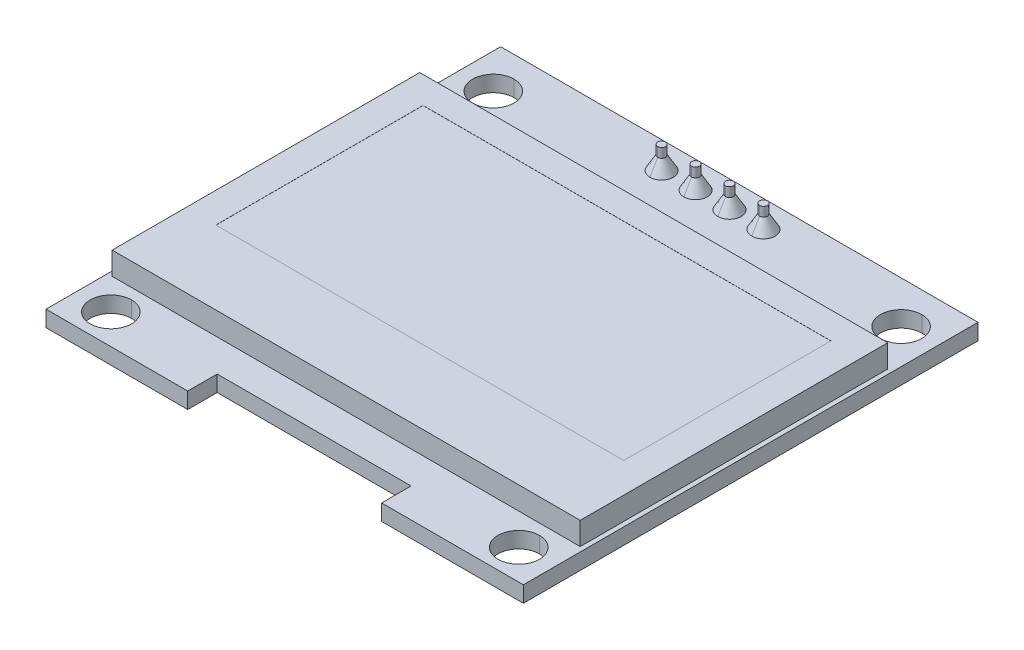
ISO-10303-21;
HEADER;
FILE_DESCRIPTION(('STEP AP214'),'2;1');
FILE_NAME('part.step','',(''),(''),'','','');
FILE_SCHEMA(('AUTOMOTIVE_DESIGN { 1 0 10303 214 1 1 1 1 }'));
ENDSEC;
DATA;
#1=APPLICATION_CONTEXT('core data for automotive mechanical design processes');
#2=APPLICATION_PROTOCOL_DEFINITION('international standard','automotive_design',2000,#1);
#3=PRODUCT_CONTEXT('',#1,'mechanical');
#4=PRODUCT('Part','Part','',(#3));
#5=PRODUCT_RELATED_PRODUCT_CATEGORY('part','',(#4));
#6=PRODUCT_DEFINITION_FORMATION('','',#4);
#7=PRODUCT_DEFINITION_CONTEXT('part definition',#1,'design');
#8=PRODUCT_DEFINITION('design','',#6,#7);
#9=PRODUCT_DEFINITION_SHAPE('','',#8);
#10=(LENGTH_UNIT() NAMED_UNIT(*) SI_UNIT(.MILLI.,.METRE.));
#11=(NAMED_UNIT(*) PLANE_ANGLE_UNIT() SI_UNIT($,.RADIAN.));
#12=(NAMED_UNIT(*) SI_UNIT($,.STERADIAN.) SOLID_ANGLE_UNIT());
#13=UNCERTAINTY_MEASURE_WITH_UNIT(LENGTH_MEASURE(1.E-05),#10,'distance_accuracy_value','');
#14=(GEOMETRIC_REPRESENTATION_CONTEXT(3) GLOBAL_UNCERTAINTY_ASSIGNED_CONTEXT((#13)) GLOBAL_UNIT_ASSIGNED_CONTEXT((#10,
#11,#12)) REPRESENTATION_CONTEXT('',''));
#15=CARTESIAN_POINT('',(0.,0.,0.));
#16=DIRECTION('',(0.,0.,1.));
#17=DIRECTION('',(1.,0.,0.));
#18=AXIS2_PLACEMENT_3D('',#15,#16,#17);
#19=CARTESIAN_POINT('',(0.,0.,0.));
#20=DIRECTION('',(0.,-1.,0.));
#21=DIRECTION('',(0.,0.,-1.));
#22=AXIS2_PLACEMENT_3D('',#19,#20,#21);
#23=PLANE('',#22);
#24=DIRECTION('',(0.,0.,-1.));
#25=VECTOR('',#24,1.);
#26=CARTESIAN_POINT('',(-5.05,0.,-13.73));
#27=LINE('',#26,#25);
#28=CARTESIAN_POINT('',(-5.05,0.,-13.73));
#29=VERTEX_POINT('',#28);
#30=CARTESIAN_POINT('',(-5.05,0.,-16.27));
#31=VERTEX_POINT('',#30);
#32=EDGE_CURVE('P0_E88',#29,#31,#27,.T.);
#33=ORIENTED_EDGE('',*,*,#32,.F.);
#34=DIRECTION('',(-1.,0.,0.));
#35=VECTOR('',#34,1.);
#36=CARTESIAN_POINT('',(-5.05,0.,-13.73));
#37=LINE('',#36,#35);
#38=CARTESIAN_POINT('',(5.05,0.,-13.73));
#39=VERTEX_POINT('',#38);
#40=EDGE_CURVE('P0_E28',#39,#29,#37,.T.);
#41=ORIENTED_EDGE('',*,*,#40,.F.);
#42=DIRECTION('',(0.,0.,1.));
#43=VECTOR('',#42,1.);
#44=CARTESIAN_POINT('',(5.05,0.,-13.73));
#45=LINE('',#44,#43);
#46=CARTESIAN_POINT('',(5.05,0.,-16.27));
#47=VERTEX_POINT('',#46);
#48=EDGE_CURVE('P0_E78',#47,#39,#45,.T.);
#49=ORIENTED_EDGE('',*,*,#48,.F.);
#50=DIRECTION('',(1.,0.,0.));
#51=VECTOR('',#50,1.);
#52=CARTESIAN_POINT('',(-5.05,0.,-16.27));
#53=LINE('',#52,#51);
#54=EDGE_CURVE('P0_E104',#31,#47,#53,.T.);
#55=ORIENTED_EDGE('',*,*,#54,.F.);
#56=EDGE_LOOP('',(#33,#41,#49,#55));
#57=FACE_BOUND('',#56,.T.);
#58=ADVANCED_FACE('P0_F17',(#57),#23,.F.);
#59=CARTESIAN_POINT('',(0.,-1.8,0.));
#60=DIRECTION('',(0.,-1.,0.));
#61=DIRECTION('',(0.,0.,-1.));
#62=AXIS2_PLACEMENT_3D('',#59,#60,#61);
#63=PLANE('',#62);
#64=DIRECTION('',(0.,0.,-1.));
#65=VECTOR('',#64,1.);
#66=CARTESIAN_POINT('',(-5.05,-1.8,-13.73));
#67=LINE('',#66,#65);
#68=CARTESIAN_POINT('',(-5.05,-1.8,-13.73));
#69=VERTEX_POINT('',#68);
#70=CARTESIAN_POINT('',(-5.05,-1.8,-16.27));
#71=VERTEX_POINT('',#70);
#72=EDGE_CURVE('P0_E80',#69,#71,#67,.T.);
#73=ORIENTED_EDGE('',*,*,#72,.T.);
#74=DIRECTION('',(1.,0.,0.));
#75=VECTOR('',#74,1.);
#76=CARTESIAN_POINT('',(-5.05,-1.8,-16.27));
#77=LINE('',#76,#75);
#78=CARTESIAN_POINT('',(5.05,-1.8,-16.27));
#79=VERTEX_POINT('',#78);
#80=EDGE_CURVE('P0_E21',#71,#79,#77,.T.);
#81=ORIENTED_EDGE('',*,*,#80,.T.);
#82=DIRECTION('',(0.,0.,1.));
#83=VECTOR('',#82,1.);
#84=CARTESIAN_POINT('',(5.05,-1.8,-13.73));
#85=LINE('',#84,#83);
#86=CARTESIAN_POINT('',(5.05,-1.8,-13.73));
#87=VERTEX_POINT('',#86);
#88=EDGE_CURVE('P0_E101',#79,#87,#85,.T.);
#89=ORIENTED_EDGE('',*,*,#88,.T.);
#90=DIRECTION('',(-1.,0.,0.));
#91=VECTOR('',#90,1.);
#92=CARTESIAN_POINT('',(-5.05,-1.8,-13.73));
#93=LINE('',#92,#91);
#94=EDGE_CURVE('P0_E11',#87,#69,#93,.T.);
#95=ORIENTED_EDGE('',*,*,#94,.T.);
#96=EDGE_LOOP('',(#73,#81,#89,#95));
#97=FACE_BOUND('',#96,.T.);
#98=ADVANCED_FACE('P0_F19',(#97),#63,.T.);
#99=CARTESIAN_POINT('',(-5.05,-1.8,-13.73));
#100=DIRECTION('',(0.,0.,-1.));
#101=DIRECTION('',(0.,-1.,0.));
#102=AXIS2_PLACEMENT_3D('',#99,#100,#101);
#103=PLANE('',#102);
#104=ORIENTED_EDGE('',*,*,#40,.T.);
#105=DIRECTION('',(0.,1.,0.));
#106=VECTOR('',#105,1.);
#107=CARTESIAN_POINT('',(-5.05,-1.8,-13.73));
#108=LINE('',#107,#106);
#109=EDGE_CURVE('P0_E84',#69,#29,#108,.T.);
#110=ORIENTED_EDGE('',*,*,#109,.F.);
#111=ORIENTED_EDGE('',*,*,#94,.F.);
#112=DIRECTION('',(0.,1.,0.));
#113=VECTOR('',#112,1.);
#114=CARTESIAN_POINT('',(5.05,-1.8,-13.73));
#115=LINE('',#114,#113);
#116=EDGE_CURVE('P0_E98',#87,#39,#115,.T.);
#117=ORIENTED_EDGE('',*,*,#116,.T.);
#118=EDGE_LOOP('',(#104,#110,#111,#117));
#119=FACE_BOUND('',#118,.T.);
#120=ADVANCED_FACE('P0_F130',(#119),#103,.F.);
#121=CARTESIAN_POINT('',(5.05,-1.8,-13.73));
#122=DIRECTION('',(-1.,0.,0.));
#123=DIRECTION('',(0.,0.,1.));
#124=AXIS2_PLACEMENT_3D('',#121,#122,#123);
#125=PLANE('',#124);
#126=ORIENTED_EDGE('',*,*,#48,.T.);
#127=ORIENTED_EDGE('',*,*,#116,.F.);
#128=ORIENTED_EDGE('',*,*,#88,.F.);
#129=DIRECTION('',(0.,1.,0.));
#130=VECTOR('',#129,1.);
#131=CARTESIAN_POINT('',(5.05,-1.8,-16.27));
#132=LINE('',#131,#130);
#133=EDGE_CURVE('P0_E76',#79,#47,#132,.T.);
#134=ORIENTED_EDGE('',*,*,#133,.T.);
#135=EDGE_LOOP('',(#126,#127,#128,#134));
#136=FACE_BOUND('',#135,.T.);
#137=ADVANCED_FACE('P0_F119',(#136),#125,.F.);
#138=CARTESIAN_POINT('',(-5.05,-1.8,-16.27));
#139=DIRECTION('',(0.,0.,1.));
#140=DIRECTION('',(1.,0.,0.));
#141=AXIS2_PLACEMENT_3D('',#138,#139,#140);
#142=PLANE('',#141);
#143=ORIENTED_EDGE('',*,*,#54,.T.);
#144=ORIENTED_EDGE('',*,*,#133,.F.);
#145=ORIENTED_EDGE('',*,*,#80,.F.);
#146=DIRECTION('',(0.,1.,0.));
#147=VECTOR('',#146,1.);
#148=CARTESIAN_POINT('',(-5.05,-1.8,-16.27));
#149=LINE('',#148,#147);
#150=EDGE_CURVE('P0_E73',#71,#31,#149,.T.);
#151=ORIENTED_EDGE('',*,*,#150,.T.);
#152=EDGE_LOOP('',(#143,#144,#145,#151));
#153=FACE_BOUND('',#152,.T.);
#154=ADVANCED_FACE('P0_F71',(#153),#142,.F.);
#155=CARTESIAN_POINT('',(-5.05,-1.8,-13.73));
#156=DIRECTION('',(1.,0.,0.));
#157=DIRECTION('',(0.,0.,1.));
#158=AXIS2_PLACEMENT_3D('',#155,#156,#157);
#159=PLANE('',#158);
#160=ORIENTED_EDGE('',*,*,#32,.T.);
#161=ORIENTED_EDGE('',*,*,#150,.F.);
#162=ORIENTED_EDGE('',*,*,#72,.F.);
#163=ORIENTED_EDGE('',*,*,#109,.T.);
#164=EDGE_LOOP('',(#160,#161,#162,#163));
#165=FACE_BOUND('',#164,.T.);
#166=ADVANCED_FACE('P0_F86',(#165),#159,.F.);
#167=CLOSED_SHELL('',(#58,#98,#120,#137,#154,#166));
#168=MANIFOLD_SOLID_BREP('P0_B1',#167);
#169=CARTESIAN_POINT('',(3.81,-8.5,-15.));
#170=DIRECTION('',(0.,-1.,0.));
#171=DIRECTION('',(0.,0.,-1.));
#172=AXIS2_PLACEMENT_3D('',#169,#170,#171);
#173=PLANE('',#172);
#174=CARTESIAN_POINT('',(3.81,-8.5,-15.));
#175=DIRECTION('',(0.,-1.,0.));
#176=DIRECTION('',(0.,0.,-1.));
#177=AXIS2_PLACEMENT_3D('',#174,#175,#176);
#178=CIRCLE('',#177,0.297649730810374);
#179=CARTESIAN_POINT('',(3.81,-8.5,-14.7023502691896));
#180=VERTEX_POINT('',#179);
#181=CARTESIAN_POINT('',(3.81,-8.5,-15.2976497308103));
#182=VERTEX_POINT('',#181);
#183=EDGE_CURVE('P1_E10',#180,#182,#178,.T.);
#184=ORIENTED_EDGE('',*,*,#183,.T.);
#185=CARTESIAN_POINT('',(3.81,-8.5,-15.));
#186=DIRECTION('',(0.,-1.,0.));
#187=DIRECTION('',(0.,0.,-1.));
#188=AXIS2_PLACEMENT_3D('',#185,#186,#187);
#189=CIRCLE('',#188,0.297649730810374);
#190=EDGE_CURVE('P1_E614',#182,#180,#189,.T.);
#191=ORIENTED_EDGE('',*,*,#190,.T.);
#192=EDGE_LOOP('',(#184,#191));
#193=FACE_BOUND('',#192,.T.);
#194=ADVANCED_FACE('P1_F16',(#193),#173,.T.);
#195=CARTESIAN_POINT('',(3.81,-8.5,-15.));
#196=DIRECTION('',(0.,1.,0.));
#197=DIRECTION('',(0.,0.,1.));
#198=AXIS2_PLACEMENT_3D('',#195,#196,#197);
#199=CYLINDRICAL_SURFACE('',#198,0.297649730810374);
#200=DIRECTION('',(0.,1.,0.));
#201=VECTOR('',#200,1.);
#202=CARTESIAN_POINT('',(3.81,-8.5,-15.2976497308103));
#203=LINE('',#202,#201);
#204=CARTESIAN_POINT('',(3.81,0.,-15.2976497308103));
#205=VERTEX_POINT('',#204);
#206=EDGE_CURVE('P1_E610',#182,#205,#203,.T.);
#207=ORIENTED_EDGE('',*,*,#206,.F.);
#208=ORIENTED_EDGE('',*,*,#183,.F.);
#209=DIRECTION('',(0.,1.,0.));
#210=VECTOR('',#209,1.);
#211=CARTESIAN_POINT('',(3.81,-8.5,-14.7023502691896));
#212=LINE('',#211,#210);
#213=CARTESIAN_POINT('',(3.81,0.,-14.7023502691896));
#214=VERTEX_POINT('',#213);
#215=EDGE_CURVE('P1_E491',#180,#214,#212,.T.);
#216=ORIENTED_EDGE('',*,*,#215,.T.);
#217=CARTESIAN_POINT('',(3.81,0.,-15.));
#218=DIRECTION('',(0.,-1.,0.));
#219=DIRECTION('',(0.,0.,-1.));
#220=AXIS2_PLACEMENT_3D('',#217,#218,#219);
#221=CIRCLE('',#220,0.297649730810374);
#222=EDGE_CURVE('P1_E510',#214,#205,#221,.T.);
#223=ORIENTED_EDGE('',*,*,#222,.T.);
#224=EDGE_LOOP('',(#207,#208,#216,#223));
#225=FACE_BOUND('',#224,.T.);
#226=ADVANCED_FACE('P1_F936',(#225),#199,.T.);
#227=CARTESIAN_POINT('',(1.27,-8.5,-15.));
#228=DIRECTION('',(0.,-1.,0.));
#229=DIRECTION('',(0.,0.,-1.));
#230=AXIS2_PLACEMENT_3D('',#227,#228,#229);
#231=PLANE('',#230);
#232=CARTESIAN_POINT('',(1.27,-8.5,-15.));
#233=DIRECTION('',(0.,-1.,0.));
#234=DIRECTION('',(0.,0.,-1.));
#235=AXIS2_PLACEMENT_3D('',#232,#233,#234);
#236=CIRCLE('',#235,0.297649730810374);
#237=CARTESIAN_POINT('',(1.27,-8.5,-14.7023502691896));
#238=VERTEX_POINT('',#237);
#239=CARTESIAN_POINT('',(1.27,-8.5,-15.2976497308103));
#240=VERTEX_POINT('',#239);
#241=EDGE_CURVE('P1_E27',#238,#240,#236,.T.);
#242=ORIENTED_EDGE('',*,*,#241,.T.);
#243=CARTESIAN_POINT('',(1.27,-8.5,-15.));
#244=DIRECTION('',(0.,-1.,0.));
#245=DIRECTION('',(0.,0.,-1.));
#246=AXIS2_PLACEMENT_3D('',#243,#244,#245);
#247=CIRCLE('',#246,0.297649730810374);
#248=EDGE_CURVE('P1_E495',#240,#238,#247,.T.);
#249=ORIENTED_EDGE('',*,*,#248,.T.);
#250=EDGE_LOOP('',(#242,#249));
#251=FACE_BOUND('',#250,.T.);
#252=ADVANCED_FACE('P1_F946',(#251),#231,.T.);
#253=CARTESIAN_POINT('',(1.27,-8.5,-15.));
#254=DIRECTION('',(0.,1.,0.));
#255=DIRECTION('',(0.,0.,1.));
#256=AXIS2_PLACEMENT_3D('',#253,#254,#255);
#257=CYLINDRICAL_SURFACE('',#256,0.297649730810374);
#258=DIRECTION('',(0.,1.,0.));
#259=VECTOR('',#258,1.);
#260=CARTESIAN_POINT('',(1.27,-8.5,-15.2976497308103));
#261=LINE('',#260,#259);
#262=CARTESIAN_POINT('',(1.27,0.,-15.2976497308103));
#263=VERTEX_POINT('',#262);
#264=EDGE_CURVE('P1_E497',#240,#263,#261,.T.);
#265=ORIENTED_EDGE('',*,*,#264,.F.);
#266=ORIENTED_EDGE('',*,*,#241,.F.);
#267=DIRECTION('',(0.,1.,0.));
#268=VECTOR('',#267,1.);
#269=CARTESIAN_POINT('',(1.27,-8.5,-14.7023502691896));
#270=LINE('',#269,#268);
#271=CARTESIAN_POINT('',(1.27,0.,-14.7023502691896));
#272=VERTEX_POINT('',#271);
#273=EDGE_CURVE('P1_E542',#238,#272,#270,.T.);
#274=ORIENTED_EDGE('',*,*,#273,.T.);
#275=CARTESIAN_POINT('',(1.27,0.,-15.));
#276=DIRECTION('',(0.,-1.,0.));
#277=DIRECTION('',(0.,0.,-1.));
#278=AXIS2_PLACEMENT_3D('',#275,#276,#277);
#279=CIRCLE('',#278,0.297649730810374);
#280=EDGE_CURVE('P1_E454',#272,#263,#279,.T.);
#281=ORIENTED_EDGE('',*,*,#280,.T.);
#282=EDGE_LOOP('',(#265,#266,#274,#281));
#283=FACE_BOUND('',#282,.T.);
#284=ADVANCED_FACE('P1_F977',(#283),#257,.T.);
#285=CARTESIAN_POINT('',(-3.81,-8.5,-15.));
#286=DIRECTION('',(0.,-1.,0.));
#287=DIRECTION('',(0.,0.,-1.));
#288=AXIS2_PLACEMENT_3D('',#285,#286,#287);
#289=PLANE('',#288);
#290=CARTESIAN_POINT('',(-3.81,-8.5,-15.));
#291=DIRECTION('',(0.,-1.,0.));
#292=DIRECTION('',(0.,0.,-1.));
#293=AXIS2_PLACEMENT_3D('',#290,#291,#292);
#294=CIRCLE('',#293,0.297649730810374);
#295=CARTESIAN_POINT('',(-3.81,-8.5,-14.7023502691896));
#296=VERTEX_POINT('',#295);
#297=CARTESIAN_POINT('',(-3.81,-8.5,-15.2976497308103));
#298=VERTEX_POINT('',#297);
#299=EDGE_CURVE('P1_E515',#296,#298,#294,.T.);
#300=ORIENTED_EDGE('',*,*,#299,.T.);
#301=CARTESIAN_POINT('',(-3.81,-8.5,-15.));
#302=DIRECTION('',(0.,-1.,0.));
#303=DIRECTION('',(0.,0.,-1.));
#304=AXIS2_PLACEMENT_3D('',#301,#302,#303);
#305=CIRCLE('',#304,0.297649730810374);
#306=EDGE_CURVE('P1_E537',#298,#296,#305,.T.);
#307=ORIENTED_EDGE('',*,*,#306,.T.);
#308=EDGE_LOOP('',(#300,#307));
#309=FACE_BOUND('',#308,.T.);
#310=ADVANCED_FACE('P1_F1009',(#309),#289,.T.);
#311=CARTESIAN_POINT('',(-3.81,-8.5,-15.));
#312=DIRECTION('',(0.,1.,0.));
#313=DIRECTION('',(0.,0.,1.));
#314=AXIS2_PLACEMENT_3D('',#311,#312,#313);
#315=CYLINDRICAL_SURFACE('',#314,0.297649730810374);
#316=DIRECTION('',(0.,1.,0.));
#317=VECTOR('',#316,1.);
#318=CARTESIAN_POINT('',(-3.81,-8.5,-15.2976497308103));
#319=LINE('',#318,#317);
#320=CARTESIAN_POINT('',(-3.81,0.,-15.2976497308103));
#321=VERTEX_POINT('',#320);
#322=EDGE_CURVE('P1_E541',#298,#321,#319,.T.);
#323=ORIENTED_EDGE('',*,*,#322,.F.);
#324=ORIENTED_EDGE('',*,*,#299,.F.);
#325=DIRECTION('',(0.,1.,0.));
#326=VECTOR('',#325,1.);
#327=CARTESIAN_POINT('',(-3.81,-8.5,-14.7023502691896));
#328=LINE('',#327,#326);
#329=CARTESIAN_POINT('',(-3.81,0.,-14.7023502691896));
#330=VERTEX_POINT('',#329);
#331=EDGE_CURVE('P1_E557',#296,#330,#328,.T.);
#332=ORIENTED_EDGE('',*,*,#331,.T.);
#333=CARTESIAN_POINT('',(-3.81,0.,-15.));
#334=DIRECTION('',(0.,-1.,0.));
#335=DIRECTION('',(0.,0.,-1.));
#336=AXIS2_PLACEMENT_3D('',#333,#334,#335);
#337=CIRCLE('',#336,0.297649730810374);
#338=EDGE_CURVE('P1_E450',#330,#321,#337,.T.);
#339=ORIENTED_EDGE('',*,*,#338,.T.);
#340=EDGE_LOOP('',(#323,#324,#332,#339));
#341=FACE_BOUND('',#340,.T.);
#342=ADVANCED_FACE('P1_F1005',(#341),#315,.T.);
#343=CARTESIAN_POINT('',(-1.27,-8.5,-15.));
#344=DIRECTION('',(0.,-1.,0.));
#345=DIRECTION('',(0.,0.,-1.));
#346=AXIS2_PLACEMENT_3D('',#343,#344,#345);
#347=PLANE('',#346);
#348=CARTESIAN_POINT('',(-1.27,-8.5,-15.));
#349=DIRECTION('',(0.,-1.,0.));
#350=DIRECTION('',(0.,0.,-1.));
#351=AXIS2_PLACEMENT_3D('',#348,#349,#350);
#352=CIRCLE('',#351,0.297649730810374);
#353=CARTESIAN_POINT('',(-1.27,-8.5,-14.7023502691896));
#354=VERTEX_POINT('',#353);
#355=CARTESIAN_POINT('',(-1.27,-8.5,-15.2976497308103));
#356=VERTEX_POINT('',#355);
#357=EDGE_CURVE('P1_E634',#354,#356,#352,.T.);
#358=ORIENTED_EDGE('',*,*,#357,.T.);
#359=CARTESIAN_POINT('',(-1.27,-8.5,-15.));
#360=DIRECTION('',(0.,-1.,0.));
#361=DIRECTION('',(0.,0.,-1.));
#362=AXIS2_PLACEMENT_3D('',#359,#360,#361);
#363=CIRCLE('',#362,0.297649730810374);
#364=EDGE_CURVE('P1_E553',#356,#354,#363,.T.);
#365=ORIENTED_EDGE('',*,*,#364,.T.);
#366=EDGE_LOOP('',(#358,#365));
#367=FACE_BOUND('',#366,.T.);
#368=ADVANCED_FACE('P1_F1008',(#367),#347,.T.);
#369=CARTESIAN_POINT('',(-1.27,-8.5,-15.));
#370=DIRECTION('',(0.,1.,0.));
#371=DIRECTION('',(0.,0.,1.));
#372=AXIS2_PLACEMENT_3D('',#369,#370,#371);
#373=CYLINDRICAL_SURFACE('',#372,0.297649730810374);
#374=DIRECTION('',(0.,1.,0.));
#375=VECTOR('',#374,1.);
#376=CARTESIAN_POINT('',(-1.27,-8.5,-15.2976497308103));
#377=LINE('',#376,#375);
#378=CARTESIAN_POINT('',(-1.27,0.,-15.2976497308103));
#379=VERTEX_POINT('',#378);
#380=EDGE_CURVE('P1_E556',#356,#379,#377,.T.);
#381=ORIENTED_EDGE('',*,*,#380,.F.);
#382=ORIENTED_EDGE('',*,*,#357,.F.);
#383=DIRECTION('',(0.,1.,0.));
#384=VECTOR('',#383,1.);
#385=CARTESIAN_POINT('',(-1.27,-8.5,-14.7023502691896));
#386=LINE('',#385,#384);
#387=CARTESIAN_POINT('',(-1.27,0.,-14.7023502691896));
#388=VERTEX_POINT('',#387);
#389=EDGE_CURVE('P1_E477',#354,#388,#386,.T.);
#390=ORIENTED_EDGE('',*,*,#389,.T.);
#391=CARTESIAN_POINT('',(-1.27,0.,-15.));
#392=DIRECTION('',(0.,-1.,0.));
#393=DIRECTION('',(0.,0.,-1.));
#394=AXIS2_PLACEMENT_3D('',#391,#392,#393);
#395=CIRCLE('',#394,0.297649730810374);
#396=EDGE_CURVE('P1_E453',#388,#379,#395,.T.);
#397=ORIENTED_EDGE('',*,*,#396,.T.);
#398=EDGE_LOOP('',(#381,#382,#390,#397));
#399=FACE_BOUND('',#398,.T.);
#400=ADVANCED_FACE('P1_F1094',(#399),#373,.T.);
#401=CARTESIAN_POINT('',(3.81,2.9,-15.));
#402=DIRECTION('',(0.,1.,0.));
#403=DIRECTION('',(1.,0.,0.));
#404=AXIS2_PLACEMENT_3D('',#401,#402,#403);
#405=PLANE('',#404);
#406=CARTESIAN_POINT('',(3.81,2.9,-15.));
#407=DIRECTION('',(0.,1.,0.));
#408=DIRECTION('',(0.,0.,1.));
#409=AXIS2_PLACEMENT_3D('',#406,#407,#408);
#410=CIRCLE('',#409,0.297649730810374);
#411=CARTESIAN_POINT('',(3.81,2.9,-15.2976497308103));
#412=VERTEX_POINT('',#411);
#413=CARTESIAN_POINT('',(3.81,2.9,-14.7023502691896));
#414=VERTEX_POINT('',#413);
#415=EDGE_CURVE('P1_E490',#412,#414,#410,.T.);
#416=ORIENTED_EDGE('',*,*,#415,.T.);
#417=CARTESIAN_POINT('',(3.81,2.9,-15.));
#418=DIRECTION('',(0.,1.,0.));
#419=DIRECTION('',(0.,0.,1.));
#420=AXIS2_PLACEMENT_3D('',#417,#418,#419);
#421=CIRCLE('',#420,0.297649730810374);
#422=EDGE_CURVE('P1_E473',#414,#412,#421,.T.);
#423=ORIENTED_EDGE('',*,*,#422,.T.);
#424=EDGE_LOOP('',(#416,#423));
#425=FACE_BOUND('',#424,.T.);
#426=ADVANCED_FACE('P1_F1041',(#425),#405,.T.);
#427=CARTESIAN_POINT('',(3.81,2.9,-15.));
#428=DIRECTION('',(0.,-1.,0.));
#429=DIRECTION('',(0.,0.,-1.));
#430=AXIS2_PLACEMENT_3D('',#427,#428,#429);
#431=CYLINDRICAL_SURFACE('',#430,0.297649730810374);
#432=DIRECTION('',(0.,-1.,0.));
#433=VECTOR('',#432,1.);
#434=CARTESIAN_POINT('',(3.81,2.9,-14.7023502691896));
#435=LINE('',#434,#433);
#436=CARTESIAN_POINT('',(3.81,2.2,-14.7023502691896));
#437=VERTEX_POINT('',#436);
#438=EDGE_CURVE('P1_E440',#414,#437,#435,.T.);
#439=ORIENTED_EDGE('',*,*,#438,.F.);
#440=ORIENTED_EDGE('',*,*,#415,.F.);
#441=DIRECTION('',(0.,-1.,0.));
#442=VECTOR('',#441,1.);
#443=CARTESIAN_POINT('',(3.81,2.9,-15.2976497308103));
#444=LINE('',#443,#442);
#445=CARTESIAN_POINT('',(3.81,2.2,-15.2976497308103));
#446=VERTEX_POINT('',#445);
#447=EDGE_CURVE('P1_E439',#412,#446,#444,.T.);
#448=ORIENTED_EDGE('',*,*,#447,.T.);
#449=CARTESIAN_POINT('',(3.81,2.2,-15.));
#450=DIRECTION('',(0.,1.,0.));
#451=DIRECTION('',(0.,0.,1.));
#452=AXIS2_PLACEMENT_3D('',#449,#450,#451);
#453=CIRCLE('',#452,0.297649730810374);
#454=EDGE_CURVE('P1_E471',#446,#437,#453,.T.);
#455=ORIENTED_EDGE('',*,*,#454,.T.);
#456=EDGE_LOOP('',(#439,#440,#448,#455));
#457=FACE_BOUND('',#456,.T.);
#458=ADVANCED_FACE('P1_F1014',(#457),#431,.T.);
#459=CARTESIAN_POINT('',(1.27,2.9,-15.));
#460=DIRECTION('',(0.,1.,0.));
#461=DIRECTION('',(1.,0.,0.));
#462=AXIS2_PLACEMENT_3D('',#459,#460,#461);
#463=PLANE('',#462);
#464=CARTESIAN_POINT('',(1.27,2.9,-15.));
#465=DIRECTION('',(0.,1.,0.));
#466=DIRECTION('',(0.,0.,1.));
#467=AXIS2_PLACEMENT_3D('',#464,#465,#466);
#468=CIRCLE('',#467,0.297649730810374);
#469=CARTESIAN_POINT('',(1.27,2.9,-15.2976497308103));
#470=VERTEX_POINT('',#469);
#471=CARTESIAN_POINT('',(1.27,2.9,-14.7023502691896));
#472=VERTEX_POINT('',#471);
#473=EDGE_CURVE('P1_E397',#470,#472,#468,.T.);
#474=ORIENTED_EDGE('',*,*,#473,.T.);
#475=CARTESIAN_POINT('',(1.27,2.9,-15.));
#476=DIRECTION('',(0.,1.,0.));
#477=DIRECTION('',(0.,0.,1.));
#478=AXIS2_PLACEMENT_3D('',#475,#476,#477);
#479=CIRCLE('',#478,0.297649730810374);
#480=EDGE_CURVE('P1_E609',#472,#470,#479,.T.);
#481=ORIENTED_EDGE('',*,*,#480,.T.);
#482=EDGE_LOOP('',(#474,#481));
#483=FACE_BOUND('',#482,.T.);
#484=ADVANCED_FACE('P1_F1010',(#483),#463,.T.);
#485=CARTESIAN_POINT('',(1.27,2.9,-15.));
#486=DIRECTION('',(0.,-1.,0.));
#487=DIRECTION('',(0.,0.,-1.));
#488=AXIS2_PLACEMENT_3D('',#485,#486,#487);
#489=CYLINDRICAL_SURFACE('',#488,0.297649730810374);
#490=DIRECTION('',(0.,-1.,0.));
#491=VECTOR('',#490,1.);
#492=CARTESIAN_POINT('',(1.27,2.9,-14.7023502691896));
#493=LINE('',#492,#491);
#494=CARTESIAN_POINT('',(1.27,2.2,-14.7023502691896));
#495=VERTEX_POINT('',#494);
#496=EDGE_CURVE('P1_E605',#472,#495,#493,.T.);
#497=ORIENTED_EDGE('',*,*,#496,.F.);
#498=ORIENTED_EDGE('',*,*,#473,.F.);
#499=DIRECTION('',(0.,-1.,0.));
#500=VECTOR('',#499,1.);
#501=CARTESIAN_POINT('',(1.27,2.9,-15.2976497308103));
#502=LINE('',#501,#500);
#503=CARTESIAN_POINT('',(1.27,2.2,-15.2976497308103));
#504=VERTEX_POINT('',#503);
#505=EDGE_CURVE('P1_E461',#470,#504,#502,.T.);
#506=ORIENTED_EDGE('',*,*,#505,.T.);
#507=CARTESIAN_POINT('',(1.27,2.2,-15.));
#508=DIRECTION('',(0.,1.,0.));
#509=DIRECTION('',(0.,0.,1.));
#510=AXIS2_PLACEMENT_3D('',#507,#508,#509);
#511=CIRCLE('',#510,0.297649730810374);
#512=EDGE_CURVE('P1_E750',#504,#495,#511,.T.);
#513=ORIENTED_EDGE('',*,*,#512,.T.);
#514=EDGE_LOOP('',(#497,#498,#506,#513));
#515=FACE_BOUND('',#514,.T.);
#516=ADVANCED_FACE('P1_F1013',(#515),#489,.T.);
#517=CARTESIAN_POINT('',(-1.27,2.9,-15.));
#518=DIRECTION('',(0.,1.,0.));
#519=DIRECTION('',(1.,0.,0.));
#520=AXIS2_PLACEMENT_3D('',#517,#518,#519);
#521=PLANE('',#520);
#522=CARTESIAN_POINT('',(-1.27,2.9,-15.));
#523=DIRECTION('',(0.,1.,0.));
#524=DIRECTION('',(0.,0.,1.));
#525=AXIS2_PLACEMENT_3D('',#522,#523,#524);
#526=CIRCLE('',#525,0.297649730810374);
#527=CARTESIAN_POINT('',(-1.27,2.9,-15.2976497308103));
#528=VERTEX_POINT('',#527);
#529=CARTESIAN_POINT('',(-1.27,2.9,-14.7023502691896));
#530=VERTEX_POINT('',#529);
#531=EDGE_CURVE('P1_E394',#528,#530,#526,.T.);
#532=ORIENTED_EDGE('',*,*,#531,.T.);
#533=CARTESIAN_POINT('',(-1.27,2.9,-15.));
#534=DIRECTION('',(0.,1.,0.));
#535=DIRECTION('',(0.,0.,1.));
#536=AXIS2_PLACEMENT_3D('',#533,#534,#535);
#537=CIRCLE('',#536,0.297649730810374);
#538=EDGE_CURVE('P1_E465',#530,#528,#537,.T.);
#539=ORIENTED_EDGE('',*,*,#538,.T.);
#540=EDGE_LOOP('',(#532,#539));
#541=FACE_BOUND('',#540,.T.);
#542=ADVANCED_FACE('P1_F962',(#541),#521,.T.);
#543=CARTESIAN_POINT('',(-1.27,2.9,-15.));
#544=DIRECTION('',(0.,-1.,0.));
#545=DIRECTION('',(0.,0.,-1.));
#546=AXIS2_PLACEMENT_3D('',#543,#544,#545);
#547=CYLINDRICAL_SURFACE('',#546,0.297649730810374);
#548=DIRECTION('',(0.,-1.,0.));
#549=VECTOR('',#548,1.);
#550=CARTESIAN_POINT('',(-1.27,2.9,-14.7023502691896));
#551=LINE('',#550,#549);
#552=CARTESIAN_POINT('',(-1.27,2.2,-14.7023502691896));
#553=VERTEX_POINT('',#552);
#554=EDGE_CURVE('P1_E522',#530,#553,#551,.T.);
#555=ORIENTED_EDGE('',*,*,#554,.F.);
#556=ORIENTED_EDGE('',*,*,#531,.F.);
#557=DIRECTION('',(0.,-1.,0.));
#558=VECTOR('',#557,1.);
#559=CARTESIAN_POINT('',(-1.27,2.9,-15.2976497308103));
#560=LINE('',#559,#558);
#561=CARTESIAN_POINT('',(-1.27,2.2,-15.2976497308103));
#562=VERTEX_POINT('',#561);
#563=EDGE_CURVE('P1_E568',#528,#562,#560,.T.);
#564=ORIENTED_EDGE('',*,*,#563,.T.);
#565=CARTESIAN_POINT('',(-1.27,2.2,-15.));
#566=DIRECTION('',(0.,1.,0.));
#567=DIRECTION('',(0.,0.,1.));
#568=AXIS2_PLACEMENT_3D('',#565,#566,#567);
#569=CIRCLE('',#568,0.297649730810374);
#570=EDGE_CURVE('P1_E588',#562,#553,#569,.T.);
#571=ORIENTED_EDGE('',*,*,#570,.T.);
#572=EDGE_LOOP('',(#555,#556,#564,#571));
#573=FACE_BOUND('',#572,.T.);
#574=ADVANCED_FACE('P1_F958',(#573),#547,.T.);
#575=CARTESIAN_POINT('',(-3.81,2.9,-15.));
#576=DIRECTION('',(0.,1.,0.));
#577=DIRECTION('',(1.,0.,0.));
#578=AXIS2_PLACEMENT_3D('',#575,#576,#577);
#579=PLANE('',#578);
#580=CARTESIAN_POINT('',(-3.81,2.9,-15.));
#581=DIRECTION('',(0.,1.,0.));
#582=DIRECTION('',(0.,0.,1.));
#583=AXIS2_PLACEMENT_3D('',#580,#581,#582);
#584=CIRCLE('',#583,0.297649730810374);
#585=CARTESIAN_POINT('',(-3.81,2.9,-15.2976497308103));
#586=VERTEX_POINT('',#585);
#587=CARTESIAN_POINT('',(-3.81,2.9,-14.7023502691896));
#588=VERTEX_POINT('',#587);
#589=EDGE_CURVE('P1_E398',#586,#588,#584,.T.);
#590=ORIENTED_EDGE('',*,*,#589,.T.);
#591=CARTESIAN_POINT('',(-3.81,2.9,-15.));
#592=DIRECTION('',(0.,1.,0.));
#593=DIRECTION('',(0.,0.,1.));
#594=AXIS2_PLACEMENT_3D('',#591,#592,#593);
#595=CIRCLE('',#594,0.297649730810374);
#596=EDGE_CURVE('P1_E572',#588,#586,#595,.T.);
#597=ORIENTED_EDGE('',*,*,#596,.T.);
#598=EDGE_LOOP('',(#590,#597));
#599=FACE_BOUND('',#598,.T.);
#600=ADVANCED_FACE('P1_F961',(#599),#579,.T.);
#601=CARTESIAN_POINT('',(-3.81,2.9,-15.));
#602=DIRECTION('',(0.,-1.,0.));
#603=DIRECTION('',(0.,0.,-1.));
#604=AXIS2_PLACEMENT_3D('',#601,#602,#603);
#605=CYLINDRICAL_SURFACE('',#604,0.297649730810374);
#606=DIRECTION('',(0.,-1.,0.));
#607=VECTOR('',#606,1.);
#608=CARTESIAN_POINT('',(-3.81,2.9,-14.7023502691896));
#609=LINE('',#608,#607);
#610=CARTESIAN_POINT('',(-3.81,2.2,-14.7023502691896));
#611=VERTEX_POINT('',#610);
#612=EDGE_CURVE('P1_E434',#588,#611,#609,.T.);
#613=ORIENTED_EDGE('',*,*,#612,.F.);
#614=ORIENTED_EDGE('',*,*,#589,.F.);
#615=DIRECTION('',(0.,-1.,0.));
#616=VECTOR('',#615,1.);
#617=CARTESIAN_POINT('',(-3.81,2.9,-15.2976497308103));
#618=LINE('',#617,#616);
#619=CARTESIAN_POINT('',(-3.81,2.2,-15.2976497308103));
#620=VERTEX_POINT('',#619);
#621=EDGE_CURVE('P1_E433',#586,#620,#618,.T.);
#622=ORIENTED_EDGE('',*,*,#621,.T.);
#623=CARTESIAN_POINT('',(-3.81,2.2,-15.));
#624=DIRECTION('',(0.,1.,0.));
#625=DIRECTION('',(0.,0.,1.));
#626=AXIS2_PLACEMENT_3D('',#623,#624,#625);
#627=CIRCLE('',#626,0.297649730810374);
#628=EDGE_CURVE('P1_E527',#620,#611,#627,.T.);
#629=ORIENTED_EDGE('',*,*,#628,.T.);
#630=EDGE_LOOP('',(#613,#614,#622,#629));
#631=FACE_BOUND('',#630,.T.);
#632=ADVANCED_FACE('P1_F984',(#631),#605,.T.);
#633=CARTESIAN_POINT('',(-1.27,1.2,-15.));
#634=DIRECTION('',(0.,-1.,0.));
#635=DIRECTION('',(0.,0.,1.));
#636=AXIS2_PLACEMENT_3D('',#633,#634,#635);
#637=CONICAL_SURFACE('',#636,0.875,0.523598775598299);
#638=DIRECTION('',(0.,-0.866025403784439,-0.5));
#639=VECTOR('',#638,1.);
#640=CARTESIAN_POINT('',(-1.27,1.2,-15.875));
#641=LINE('',#640,#639);
#642=CARTESIAN_POINT('',(-1.27,1.2,-15.875));
#643=VERTEX_POINT('',#642);
#644=EDGE_CURVE('P1_E592',#562,#643,#641,.T.);
#645=ORIENTED_EDGE('',*,*,#644,.F.);
#646=CARTESIAN_POINT('',(-1.27,2.2,-15.));
#647=DIRECTION('',(0.,1.,0.));
#648=DIRECTION('',(0.,0.,1.));
#649=AXIS2_PLACEMENT_3D('',#646,#647,#648);
#650=CIRCLE('',#649,0.297649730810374);
#651=EDGE_CURVE('P1_E573',#553,#562,#650,.T.);
#652=ORIENTED_EDGE('',*,*,#651,.F.);
#653=DIRECTION('',(0.,-0.866025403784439,0.5));
#654=VECTOR('',#653,1.);
#655=CARTESIAN_POINT('',(-1.27,1.2,-14.125));
#656=LINE('',#655,#654);
#657=CARTESIAN_POINT('',(-1.27,1.2,-14.125));
#658=VERTEX_POINT('',#657);
#659=EDGE_CURVE('P1_E629',#553,#658,#656,.T.);
#660=ORIENTED_EDGE('',*,*,#659,.T.);
#661=CARTESIAN_POINT('',(-1.27,1.2,-15.));
#662=DIRECTION('',(0.,1.,0.));
#663=DIRECTION('',(0.,0.,-1.));
#664=AXIS2_PLACEMENT_3D('',#661,#662,#663);
#665=CIRCLE('',#664,0.875);
#666=EDGE_CURVE('P1_E620',#658,#643,#665,.T.);
#667=ORIENTED_EDGE('',*,*,#666,.T.);
#668=EDGE_LOOP('',(#645,#652,#660,#667));
#669=FACE_BOUND('',#668,.T.);
#670=ADVANCED_FACE('P1_F987',(#669),#637,.T.);
#671=CARTESIAN_POINT('',(1.27,1.2,-15.));
#672=DIRECTION('',(0.,-1.,0.));
#673=DIRECTION('',(0.,0.,1.));
#674=AXIS2_PLACEMENT_3D('',#671,#672,#673);
#675=CONICAL_SURFACE('',#674,0.875,0.523598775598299);
#676=DIRECTION('',(0.,-0.866025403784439,-0.5));
#677=VECTOR('',#676,1.);
#678=CARTESIAN_POINT('',(1.27,1.2,-15.875));
#679=LINE('',#678,#677);
#680=CARTESIAN_POINT('',(1.27,1.2,-15.875));
#681=VERTEX_POINT('',#680);
#682=EDGE_CURVE('P1_E552',#504,#681,#679,.T.);
#683=ORIENTED_EDGE('',*,*,#682,.F.);
#684=CARTESIAN_POINT('',(1.27,2.2,-15.));
#685=DIRECTION('',(0.,1.,0.));
#686=DIRECTION('',(0.,0.,1.));
#687=AXIS2_PLACEMENT_3D('',#684,#685,#686);
#688=CIRCLE('',#687,0.297649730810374);
#689=EDGE_CURVE('P1_E466',#495,#504,#688,.T.);
#690=ORIENTED_EDGE('',*,*,#689,.F.);
#691=DIRECTION('',(0.,-0.866025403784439,0.5));
#692=VECTOR('',#691,1.);
#693=CARTESIAN_POINT('',(1.27,1.2,-14.125));
#694=LINE('',#693,#692);
#695=CARTESIAN_POINT('',(1.27,1.2,-14.125));
#696=VERTEX_POINT('',#695);
#697=EDGE_CURVE('P1_E467',#495,#696,#694,.T.);
#698=ORIENTED_EDGE('',*,*,#697,.T.);
#699=CARTESIAN_POINT('',(1.27,1.2,-15.));
#700=DIRECTION('',(0.,1.,0.));
#701=DIRECTION('',(0.,0.,-1.));
#702=AXIS2_PLACEMENT_3D('',#699,#700,#701);
#703=CIRCLE('',#702,0.875);
#704=EDGE_CURVE('P1_E690',#696,#681,#703,.T.);
#705=ORIENTED_EDGE('',*,*,#704,.T.);
#706=EDGE_LOOP('',(#683,#690,#698,#705));
#707=FACE_BOUND('',#706,.T.);
#708=ADVANCED_FACE('P1_F956',(#707),#675,.T.);
#709=CARTESIAN_POINT('',(3.81,1.2,-15.));
#710=DIRECTION('',(0.,-1.,0.));
#711=DIRECTION('',(0.,0.,1.));
#712=AXIS2_PLACEMENT_3D('',#709,#710,#711);
#713=CONICAL_SURFACE('',#712,0.875,0.523598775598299);
#714=DIRECTION('',(0.,-0.866025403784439,-0.5));
#715=VECTOR('',#714,1.);
#716=CARTESIAN_POINT('',(3.81,1.2,-15.875));
#717=LINE('',#716,#715);
#718=CARTESIAN_POINT('',(3.81,1.2,-15.875));
#719=VERTEX_POINT('',#718);
#720=EDGE_CURVE('P1_E584',#446,#719,#717,.T.);
#721=ORIENTED_EDGE('',*,*,#720,.F.);
#722=CARTESIAN_POINT('',(3.81,2.2,-15.));
#723=DIRECTION('',(0.,1.,0.));
#724=DIRECTION('',(0.,0.,1.));
#725=AXIS2_PLACEMENT_3D('',#722,#723,#724);
#726=CIRCLE('',#725,0.297649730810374);
#727=EDGE_CURVE('P1_E435',#437,#446,#726,.T.);
#728=ORIENTED_EDGE('',*,*,#727,.F.);
#729=DIRECTION('',(0.,-0.866025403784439,0.5));
#730=VECTOR('',#729,1.);
#731=CARTESIAN_POINT('',(3.81,1.2,-14.125));
#732=LINE('',#731,#730);
#733=CARTESIAN_POINT('',(3.81,1.2,-14.125));
#734=VERTEX_POINT('',#733);
#735=EDGE_CURVE('P1_E523',#437,#734,#732,.T.);
#736=ORIENTED_EDGE('',*,*,#735,.T.);
#737=CARTESIAN_POINT('',(3.81,1.2,-15.));
#738=DIRECTION('',(0.,1.,0.));
#739=DIRECTION('',(0.,0.,-1.));
#740=AXIS2_PLACEMENT_3D('',#737,#738,#739);
#741=CIRCLE('',#740,0.875);
#742=EDGE_CURVE('P1_E738',#734,#719,#741,.T.);
#743=ORIENTED_EDGE('',*,*,#742,.T.);
#744=EDGE_LOOP('',(#721,#728,#736,#743));
#745=FACE_BOUND('',#744,.T.);
#746=ADVANCED_FACE('P1_F952',(#745),#713,.T.);
#747=CARTESIAN_POINT('',(-3.81,1.2,-15.));
#748=DIRECTION('',(0.,-1.,0.));
#749=DIRECTION('',(0.,0.,1.));
#750=AXIS2_PLACEMENT_3D('',#747,#748,#749);
#751=CONICAL_SURFACE('',#750,0.875,0.523598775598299);
#752=DIRECTION('',(0.,-0.866025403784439,-0.5));
#753=VECTOR('',#752,1.);
#754=CARTESIAN_POINT('',(-3.81,1.2,-15.875));
#755=LINE('',#754,#753);
#756=CARTESIAN_POINT('',(-3.81,1.2,-15.875));
#757=VERTEX_POINT('',#756);
#758=EDGE_CURVE('P1_E566',#620,#757,#755,.T.);
#759=ORIENTED_EDGE('',*,*,#758,.F.);
#760=CARTESIAN_POINT('',(-3.81,2.2,-15.));
#761=DIRECTION('',(0.,1.,0.));
#762=DIRECTION('',(0.,0.,1.));
#763=AXIS2_PLACEMENT_3D('',#760,#761,#762);
#764=CIRCLE('',#763,0.297649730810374);
#765=EDGE_CURVE('P1_E429',#611,#620,#764,.T.);
#766=ORIENTED_EDGE('',*,*,#765,.F.);
#767=DIRECTION('',(0.,-0.866025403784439,0.5));
#768=VECTOR('',#767,1.);
#769=CARTESIAN_POINT('',(-3.81,1.2,-14.125));
#770=LINE('',#769,#768);
#771=CARTESIAN_POINT('',(-3.81,1.2,-14.125));
#772=VERTEX_POINT('',#771);
#773=EDGE_CURVE('P1_E579',#611,#772,#770,.T.);
#774=ORIENTED_EDGE('',*,*,#773,.T.);
#775=CARTESIAN_POINT('',(-3.81,1.2,-15.));
#776=DIRECTION('',(0.,1.,0.));
#777=DIRECTION('',(0.,0.,-1.));
#778=AXIS2_PLACEMENT_3D('',#775,#776,#777);
#779=CIRCLE('',#778,0.875);
#780=EDGE_CURVE('P1_E583',#772,#757,#779,.T.);
#781=ORIENTED_EDGE('',*,*,#780,.T.);
#782=EDGE_LOOP('',(#759,#766,#774,#781));
#783=FACE_BOUND('',#782,.T.);
#784=ADVANCED_FACE('P1_F955',(#783),#751,.T.);
#785=CARTESIAN_POINT('',(7.25,0.,17.));
#786=DIRECTION('',(1.,0.,0.));
#787=DIRECTION('',(0.,1.,0.));
#788=AXIS2_PLACEMENT_3D('',#785,#786,#787);
#789=PLANE('',#788);
#790=DIRECTION('',(0.,0.,-1.));
#791=VECTOR('',#790,1.);
#792=CARTESIAN_POINT('',(7.25,1.2,17.));
#793=LINE('',#792,#791);
#794=CARTESIAN_POINT('',(7.25,1.2,17.));
#795=VERTEX_POINT('',#794);
#796=CARTESIAN_POINT('',(7.25,1.2,14.8));
#797=VERTEX_POINT('',#796);
#798=EDGE_CURVE('P1_E509',#795,#797,#793,.T.);
#799=ORIENTED_EDGE('',*,*,#798,.T.);
#800=DIRECTION('',(0.,1.,0.));
#801=VECTOR('',#800,1.);
#802=CARTESIAN_POINT('',(7.25,0.,14.8));
#803=LINE('',#802,#801);
#804=CARTESIAN_POINT('',(7.25,0.,14.8));
#805=VERTEX_POINT('',#804);
#806=EDGE_CURVE('P1_E808',#805,#797,#803,.T.);
#807=ORIENTED_EDGE('',*,*,#806,.F.);
#808=DIRECTION('',(0.,0.,-1.));
#809=VECTOR('',#808,1.);
#810=CARTESIAN_POINT('',(7.25,0.,17.));
#811=LINE('',#810,#809);
#812=CARTESIAN_POINT('',(7.25,0.,17.));
#813=VERTEX_POINT('',#812);
#814=EDGE_CURVE('P1_E349',#813,#805,#811,.T.);
#815=ORIENTED_EDGE('',*,*,#814,.F.);
#816=DIRECTION('',(0.,1.,0.));
#817=VECTOR('',#816,1.);
#818=CARTESIAN_POINT('',(7.25,0.,17.));
#819=LINE('',#818,#817);
#820=EDGE_CURVE('P1_E621',#813,#795,#819,.T.);
#821=ORIENTED_EDGE('',*,*,#820,.T.);
#822=EDGE_LOOP('',(#799,#807,#815,#821));
#823=FACE_BOUND('',#822,.T.);
#824=ADVANCED_FACE('P1_F967',(#823),#789,.F.);
#825=CARTESIAN_POINT('',(-7.25,0.,14.8));
#826=DIRECTION('',(0.,0.,-1.));
#827=DIRECTION('',(-1.,0.,0.));
#828=AXIS2_PLACEMENT_3D('',#825,#826,#827);
#829=PLANE('',#828);
#830=DIRECTION('',(-1.,0.,0.));
#831=VECTOR('',#830,1.);
#832=CARTESIAN_POINT('',(-7.25,1.2,14.8));
#833=LINE('',#832,#831);
#834=CARTESIAN_POINT('',(-7.25,1.2,14.8));
#835=VERTEX_POINT('',#834);
#836=EDGE_CURVE('P1_E505',#797,#835,#833,.T.);
#837=ORIENTED_EDGE('',*,*,#836,.T.);
#838=DIRECTION('',(0.,1.,0.));
#839=VECTOR('',#838,1.);
#840=CARTESIAN_POINT('',(-7.25,0.,14.8));
#841=LINE('',#840,#839);
#842=CARTESIAN_POINT('',(-7.25,0.,14.8));
#843=VERTEX_POINT('',#842);
#844=EDGE_CURVE('P1_E383',#843,#835,#841,.T.);
#845=ORIENTED_EDGE('',*,*,#844,.F.);
#846=DIRECTION('',(-1.,0.,0.));
#847=VECTOR('',#846,1.);
#848=CARTESIAN_POINT('',(-7.25,0.,14.8));
#849=LINE('',#848,#847);
#850=EDGE_CURVE('P1_E346',#805,#843,#849,.T.);
#851=ORIENTED_EDGE('',*,*,#850,.F.);
#852=ORIENTED_EDGE('',*,*,#806,.T.);
#853=EDGE_LOOP('',(#837,#845,#851,#852));
#854=FACE_BOUND('',#853,.T.);
#855=ADVANCED_FACE('P1_F964',(#854),#829,.F.);
#856=CARTESIAN_POINT('',(-7.25,0.,17.));
#857=DIRECTION('',(-1.,0.,0.));
#858=DIRECTION('',(0.,0.,1.));
#859=AXIS2_PLACEMENT_3D('',#856,#857,#858);
#860=PLANE('',#859);
#861=DIRECTION('',(0.,0.,1.));
#862=VECTOR('',#861,1.);
#863=CARTESIAN_POINT('',(-7.25,1.2,17.));
#864=LINE('',#863,#862);
#865=CARTESIAN_POINT('',(-7.25,1.2,17.));
#866=VERTEX_POINT('',#865);
#867=EDGE_CURVE('P1_E356',#835,#866,#864,.T.);
#868=ORIENTED_EDGE('',*,*,#867,.T.);
#869=DIRECTION('',(0.,1.,0.));
#870=VECTOR('',#869,1.);
#871=CARTESIAN_POINT('',(-7.25,0.,17.));
#872=LINE('',#871,#870);
#873=CARTESIAN_POINT('',(-7.25,0.,17.));
#874=VERTEX_POINT('',#873);
#875=EDGE_CURVE('P1_E353',#874,#866,#872,.T.);
#876=ORIENTED_EDGE('',*,*,#875,.F.);
#877=DIRECTION('',(0.,0.,1.));
#878=VECTOR('',#877,1.);
#879=CARTESIAN_POINT('',(-7.25,0.,17.));
#880=LINE('',#879,#878);
#881=EDGE_CURVE('P1_E339',#843,#874,#880,.T.);
#882=ORIENTED_EDGE('',*,*,#881,.F.);
#883=ORIENTED_EDGE('',*,*,#844,.T.);
#884=EDGE_LOOP('',(#868,#876,#882,#883));
#885=FACE_BOUND('',#884,.T.);
#886=ADVANCED_FACE('P1_F354',(#885),#860,.F.);
#887=CARTESIAN_POINT('',(0.,2.89,0.));
#888=DIRECTION('',(0.,1.,0.));
#889=DIRECTION('',(1.,0.,0.));
#890=AXIS2_PLACEMENT_3D('',#887,#888,#889);
#891=PLANE('',#890);
#892=DIRECTION('',(0.,0.,1.));
#893=VECTOR('',#892,1.);
#894=CARTESIAN_POINT('',(-15.25,2.89,-8.6));
#895=LINE('',#894,#893);
#896=CARTESIAN_POINT('',(-15.25,2.89,-8.6));
#897=VERTEX_POINT('',#896);
#898=CARTESIAN_POINT('',(-15.25,2.89,6.9));
#899=VERTEX_POINT('',#898);
#900=EDGE_CURVE('P1_E20',#897,#899,#895,.T.);
#901=ORIENTED_EDGE('',*,*,#900,.T.);
#902=DIRECTION('',(1.,0.,0.));
#903=VECTOR('',#902,1.);
#904=CARTESIAN_POINT('',(-15.25,2.89,6.9));
#905=LINE('',#904,#903);
#906=CARTESIAN_POINT('',(15.25,2.89,6.9));
#907=VERTEX_POINT('',#906);
#908=EDGE_CURVE('P1_E42',#899,#907,#905,.T.);
#909=ORIENTED_EDGE('',*,*,#908,.T.);
#910=DIRECTION('',(0.,0.,-1.));
#911=VECTOR('',#910,1.);
#912=CARTESIAN_POINT('',(15.25,2.89,-8.6));
#913=LINE('',#912,#911);
#914=CARTESIAN_POINT('',(15.25,2.89,-8.6));
#915=VERTEX_POINT('',#914);
#916=EDGE_CURVE('P1_E444',#907,#915,#913,.T.);
#917=ORIENTED_EDGE('',*,*,#916,.T.);
#918=DIRECTION('',(-1.,0.,0.));
#919=VECTOR('',#918,1.);
#920=CARTESIAN_POINT('',(-15.25,2.89,-8.6));
#921=LINE('',#920,#919);
#922=EDGE_CURVE('P1_E393',#915,#897,#921,.T.);
#923=ORIENTED_EDGE('',*,*,#922,.T.);
#924=EDGE_LOOP('',(#901,#909,#917,#923));
#925=FACE_BOUND('',#924,.T.);
#926=ADVANCED_FACE('P1_F1034',(#925),#891,.T.);
#927=CARTESIAN_POINT('',(-15.25,2.89,6.9));
#928=DIRECTION('',(0.,0.,1.));
#929=DIRECTION('',(1.,0.,0.));
#930=AXIS2_PLACEMENT_3D('',#927,#928,#929);
#931=PLANE('',#930);
#932=DIRECTION('',(1.,0.,0.));
#933=VECTOR('',#932,1.);
#934=CARTESIAN_POINT('',(-15.25,2.9,6.9));
#935=LINE('',#934,#933);
#936=CARTESIAN_POINT('',(-15.25,2.9,6.9));
#937=VERTEX_POINT('',#936);
#938=CARTESIAN_POINT('',(15.25,2.9,6.9));
#939=VERTEX_POINT('',#938);
#940=EDGE_CURVE('P1_E700',#937,#939,#935,.T.);
#941=ORIENTED_EDGE('',*,*,#940,.T.);
#942=DIRECTION('',(0.,1.,0.));
#943=VECTOR('',#942,1.);
#944=CARTESIAN_POINT('',(15.25,2.89,6.9));
#945=LINE('',#944,#943);
#946=EDGE_CURVE('P1_E384',#907,#939,#945,.T.);
#947=ORIENTED_EDGE('',*,*,#946,.F.);
#948=ORIENTED_EDGE('',*,*,#908,.F.);
#949=DIRECTION('',(0.,1.,0.));
#950=VECTOR('',#949,1.);
#951=CARTESIAN_POINT('',(-15.25,2.89,6.9));
#952=LINE('',#951,#950);
#953=EDGE_CURVE('P1_E696',#899,#937,#952,.T.);
#954=ORIENTED_EDGE('',*,*,#953,.T.);
#955=EDGE_LOOP('',(#941,#947,#948,#954));
#956=FACE_BOUND('',#955,.T.);
#957=ADVANCED_FACE('P1_F982',(#956),#931,.F.);
#958=CARTESIAN_POINT('',(15.25,2.89,-8.6));
#959=DIRECTION('',(1.,0.,0.));
#960=DIRECTION('',(0.,0.,1.));
#961=AXIS2_PLACEMENT_3D('',#958,#959,#960);
#962=PLANE('',#961);
#963=DIRECTION('',(0.,0.,-1.));
#964=VECTOR('',#963,1.);
#965=CARTESIAN_POINT('',(15.25,2.9,-8.6));
#966=LINE('',#965,#964);
#967=CARTESIAN_POINT('',(15.25,2.9,-8.6));
#968=VERTEX_POINT('',#967);
#969=EDGE_CURVE('P1_E793',#939,#968,#966,.T.);
#970=ORIENTED_EDGE('',*,*,#969,.T.);
#971=DIRECTION('',(0.,1.,0.));
#972=VECTOR('',#971,1.);
#973=CARTESIAN_POINT('',(15.25,2.89,-8.6));
#974=LINE('',#973,#972);
#975=EDGE_CURVE('P1_E441',#915,#968,#974,.T.);
#976=ORIENTED_EDGE('',*,*,#975,.F.);
#977=ORIENTED_EDGE('',*,*,#916,.F.);
#978=ORIENTED_EDGE('',*,*,#946,.T.);
#979=EDGE_LOOP('',(#970,#976,#977,#978));
#980=FACE_BOUND('',#979,.T.);
#981=ADVANCED_FACE('P1_F979',(#980),#962,.F.);
#982=CARTESIAN_POINT('',(-15.25,2.89,-8.6));
#983=DIRECTION('',(0.,0.,-1.));
#984=DIRECTION('',(0.,-1.,0.));
#985=AXIS2_PLACEMENT_3D('',#982,#983,#984);
#986=PLANE('',#985);
#987=DIRECTION('',(-1.,0.,0.));
#988=VECTOR('',#987,1.);
#989=CARTESIAN_POINT('',(-15.25,2.9,-8.6));
#990=LINE('',#989,#988);
#991=CARTESIAN_POINT('',(-15.25,2.9,-8.6));
#992=VERTEX_POINT('',#991);
#993=EDGE_CURVE('P1_E600',#968,#992,#990,.T.);
#994=ORIENTED_EDGE('',*,*,#993,.T.);
#995=DIRECTION('',(0.,1.,0.));
#996=VECTOR('',#995,1.);
#997=CARTESIAN_POINT('',(-15.25,2.89,-8.6));
#998=LINE('',#997,#996);
#999=EDGE_CURVE('P1_E390',#897,#992,#998,.T.);
#1000=ORIENTED_EDGE('',*,*,#999,.F.);
#1001=ORIENTED_EDGE('',*,*,#922,.F.);
#1002=ORIENTED_EDGE('',*,*,#975,.T.);
#1003=EDGE_LOOP('',(#994,#1000,#1001,#1002));
#1004=FACE_BOUND('',#1003,.T.);
#1005=ADVANCED_FACE('P1_F842',(#1004),#986,.F.);
#1006=CARTESIAN_POINT('',(-15.25,2.89,-8.6));
#1007=DIRECTION('',(-1.,0.,0.));
#1008=DIRECTION('',(0.,1.,0.));
#1009=AXIS2_PLACEMENT_3D('',#1006,#1007,#1008);
#1010=PLANE('',#1009);
#1011=DIRECTION('',(0.,0.,1.));
#1012=VECTOR('',#1011,1.);
#1013=CARTESIAN_POINT('',(-15.25,2.9,-8.6));
#1014=LINE('',#1013,#1012);
#1015=EDGE_CURVE('P1_E596',#992,#937,#1014,.T.);
#1016=ORIENTED_EDGE('',*,*,#1015,.T.);
#1017=ORIENTED_EDGE('',*,*,#953,.F.);
#1018=ORIENTED_EDGE('',*,*,#900,.F.);
#1019=ORIENTED_EDGE('',*,*,#999,.T.);
#1020=EDGE_LOOP('',(#1016,#1017,#1018,#1019));
#1021=FACE_BOUND('',#1020,.T.);
#1022=ADVANCED_FACE('P1_F853',(#1021),#1010,.F.);
#1023=CARTESIAN_POINT('',(0.,2.9,0.));
#1024=DIRECTION('',(0.,1.,0.));
#1025=DIRECTION('',(1.,0.,0.));
#1026=AXIS2_PLACEMENT_3D('',#1023,#1024,#1025);
#1027=PLANE('',#1026);
#1028=ORIENTED_EDGE('',*,*,#1015,.F.);
#1029=ORIENTED_EDGE('',*,*,#993,.F.);
#1030=ORIENTED_EDGE('',*,*,#969,.F.);
#1031=ORIENTED_EDGE('',*,*,#940,.F.);
#1032=EDGE_LOOP('',(#1028,#1029,#1030,#1031));
#1033=FACE_BOUND('',#1032,.T.);
#1034=DIRECTION('',(0.,0.,1.));
#1035=VECTOR('',#1034,1.);
#1036=CARTESIAN_POINT('',(-17.5,2.9,-10.6));
#1037=LINE('',#1036,#1035);
#1038=CARTESIAN_POINT('',(-17.5,2.9,-10.6));
#1039=VERTEX_POINT('',#1038);
#1040=CARTESIAN_POINT('',(-17.5,2.9,12.4));
#1041=VERTEX_POINT('',#1040);
#1042=EDGE_CURVE('P1_E504',#1039,#1041,#1037,.T.);
#1043=ORIENTED_EDGE('',*,*,#1042,.T.);
#1044=DIRECTION('',(1.,0.,0.));
#1045=VECTOR('',#1044,1.);
#1046=CARTESIAN_POINT('',(-17.5,2.9,12.4));
#1047=LINE('',#1046,#1045);
#1048=CARTESIAN_POINT('',(17.5,2.9,12.4));
#1049=VERTEX_POINT('',#1048);
#1050=EDGE_CURVE('P1_E448',#1041,#1049,#1047,.T.);
#1051=ORIENTED_EDGE('',*,*,#1050,.T.);
#1052=DIRECTION('',(0.,0.,-1.));
#1053=VECTOR('',#1052,1.);
#1054=CARTESIAN_POINT('',(17.5,2.9,-10.6));
#1055=LINE('',#1054,#1053);
#1056=CARTESIAN_POINT('',(17.5,2.9,-10.6));
#1057=VERTEX_POINT('',#1056);
#1058=EDGE_CURVE('P1_E704',#1049,#1057,#1055,.T.);
#1059=ORIENTED_EDGE('',*,*,#1058,.T.);
#1060=DIRECTION('',(-1.,0.,0.));
#1061=VECTOR('',#1060,1.);
#1062=CARTESIAN_POINT('',(-17.5,2.9,-10.6));
#1063=LINE('',#1062,#1061);
#1064=EDGE_CURVE('P1_E601',#1057,#1039,#1063,.T.);
#1065=ORIENTED_EDGE('',*,*,#1064,.T.);
#1066=EDGE_LOOP('',(#1043,#1051,#1059,#1065));
#1067=FACE_BOUND('',#1066,.T.);
#1068=ADVANCED_FACE('P1_F849',(#1033,#1067),#1027,.T.);
#1069=CARTESIAN_POINT('',(-17.5,2.9,-10.6));
#1070=DIRECTION('',(0.,0.,1.));
#1071=DIRECTION('',(1.,0.,0.));
#1072=AXIS2_PLACEMENT_3D('',#1069,#1070,#1071);
#1073=PLANE('',#1072);
#1074=DIRECTION('',(-1.,0.,0.));
#1075=VECTOR('',#1074,1.);
#1076=CARTESIAN_POINT('',(-17.5,1.2,-10.6));
#1077=LINE('',#1076,#1075);
#1078=CARTESIAN_POINT('',(17.5,1.2,-10.6));
#1079=VERTEX_POINT('',#1078);
#1080=CARTESIAN_POINT('',(-17.5,1.2,-10.6));
#1081=VERTEX_POINT('',#1080);
#1082=EDGE_CURVE('P1_E654',#1079,#1081,#1077,.T.);
#1083=ORIENTED_EDGE('',*,*,#1082,.T.);
#1084=DIRECTION('',(0.,-1.,0.));
#1085=VECTOR('',#1084,1.);
#1086=CARTESIAN_POINT('',(-17.5,2.9,-10.6));
#1087=LINE('',#1086,#1085);
#1088=EDGE_CURVE('P1_E449',#1039,#1081,#1087,.T.);
#1089=ORIENTED_EDGE('',*,*,#1088,.F.);
#1090=ORIENTED_EDGE('',*,*,#1064,.F.);
#1091=DIRECTION('',(0.,-1.,0.));
#1092=VECTOR('',#1091,1.);
#1093=CARTESIAN_POINT('',(17.5,2.9,-10.6));
#1094=LINE('',#1093,#1092);
#1095=EDGE_CURVE('P1_E643',#1057,#1079,#1094,.T.);
#1096=ORIENTED_EDGE('',*,*,#1095,.T.);
#1097=EDGE_LOOP('',(#1083,#1089,#1090,#1096));
#1098=FACE_BOUND('',#1097,.T.);
#1099=ADVANCED_FACE('P1_F1024',(#1098),#1073,.F.);
#1100=CARTESIAN_POINT('',(17.5,2.9,-10.6));
#1101=DIRECTION('',(-1.,0.,0.));
#1102=DIRECTION('',(0.,0.,1.));
#1103=AXIS2_PLACEMENT_3D('',#1100,#1101,#1102);
#1104=PLANE('',#1103);
#1105=DIRECTION('',(0.,0.,-1.));
#1106=VECTOR('',#1105,1.);
#1107=CARTESIAN_POINT('',(17.5,1.2,-10.6));
#1108=LINE('',#1107,#1106);
#1109=CARTESIAN_POINT('',(17.5,1.2,12.4));
#1110=VERTEX_POINT('',#1109);
#1111=EDGE_CURVE('P1_E675',#1110,#1079,#1108,.T.);
#1112=ORIENTED_EDGE('',*,*,#1111,.T.);
#1113=ORIENTED_EDGE('',*,*,#1095,.F.);
#1114=ORIENTED_EDGE('',*,*,#1058,.F.);
#1115=DIRECTION('',(0.,-1.,0.));
#1116=VECTOR('',#1115,1.);
#1117=CARTESIAN_POINT('',(17.5,2.9,12.4));
#1118=LINE('',#1117,#1116);
#1119=EDGE_CURVE('P1_E445',#1049,#1110,#1118,.T.);
#1120=ORIENTED_EDGE('',*,*,#1119,.T.);
#1121=EDGE_LOOP('',(#1112,#1113,#1114,#1120));
#1122=FACE_BOUND('',#1121,.T.);
#1123=ADVANCED_FACE('P1_F1055',(#1122),#1104,.F.);
#1124=CARTESIAN_POINT('',(-17.5,2.9,12.4));
#1125=DIRECTION('',(0.,0.,-1.));
#1126=DIRECTION('',(0.,-1.,0.));
#1127=AXIS2_PLACEMENT_3D('',#1124,#1125,#1126);
#1128=PLANE('',#1127);
#1129=DIRECTION('',(1.,0.,0.));
#1130=VECTOR('',#1129,1.);
#1131=CARTESIAN_POINT('',(-17.5,1.2,12.4));
#1132=LINE('',#1131,#1130);
#1133=CARTESIAN_POINT('',(-17.5,1.2,12.4));
#1134=VERTEX_POINT('',#1133);
#1135=EDGE_CURVE('P1_E423',#1134,#1110,#1132,.T.);
#1136=ORIENTED_EDGE('',*,*,#1135,.T.);
#1137=ORIENTED_EDGE('',*,*,#1119,.F.);
#1138=ORIENTED_EDGE('',*,*,#1050,.F.);
#1139=DIRECTION('',(0.,-1.,0.));
#1140=VECTOR('',#1139,1.);
#1141=CARTESIAN_POINT('',(-17.5,2.9,12.4));
#1142=LINE('',#1141,#1140);
#1143=EDGE_CURVE('P1_E759',#1041,#1134,#1142,.T.);
#1144=ORIENTED_EDGE('',*,*,#1143,.T.);
#1145=EDGE_LOOP('',(#1136,#1137,#1138,#1144));
#1146=FACE_BOUND('',#1145,.T.);
#1147=ADVANCED_FACE('P1_F1078',(#1146),#1128,.F.);
#1148=CARTESIAN_POINT('',(-17.5,2.9,-10.6));
#1149=DIRECTION('',(1.,0.,0.));
#1150=DIRECTION('',(0.,0.,-1.));
#1151=AXIS2_PLACEMENT_3D('',#1148,#1149,#1150);
#1152=PLANE('',#1151);
#1153=DIRECTION('',(0.,0.,1.));
#1154=VECTOR('',#1153,1.);
#1155=CARTESIAN_POINT('',(-17.5,1.2,-10.6));
#1156=LINE('',#1155,#1154);
#1157=EDGE_CURVE('P1_E563',#1081,#1134,#1156,.T.);
#1158=ORIENTED_EDGE('',*,*,#1157,.T.);
#1159=ORIENTED_EDGE('',*,*,#1143,.F.);
#1160=ORIENTED_EDGE('',*,*,#1042,.F.);
#1161=ORIENTED_EDGE('',*,*,#1088,.T.);
#1162=EDGE_LOOP('',(#1158,#1159,#1160,#1161));
#1163=FACE_BOUND('',#1162,.T.);
#1164=ADVANCED_FACE('P1_F1081',(#1163),#1152,.F.);
#1165=CARTESIAN_POINT('',(-15.25,0.,14.75));
#1166=DIRECTION('',(0.,1.,0.));
#1167=DIRECTION('',(0.,0.,1.));
#1168=AXIS2_PLACEMENT_3D('',#1165,#1166,#1167);
#1169=CYLINDRICAL_SURFACE('',#1168,1.55);
#1170=DIRECTION('',(0.,1.,0.));
#1171=VECTOR('',#1170,1.);
#1172=CARTESIAN_POINT('',(-15.25,0.,13.2));
#1173=LINE('',#1172,#1171);
#1174=CARTESIAN_POINT('',(-15.25,0.,13.2));
#1175=VERTEX_POINT('',#1174);
#1176=CARTESIAN_POINT('',(-15.25,1.2,13.2));
#1177=VERTEX_POINT('',#1176);
#1178=EDGE_CURVE('P1_E578',#1175,#1177,#1173,.T.);
#1179=ORIENTED_EDGE('',*,*,#1178,.F.);
#1180=CARTESIAN_POINT('',(-15.25,0.,14.75));
#1181=DIRECTION('',(0.,1.,0.));
#1182=DIRECTION('',(0.,0.,1.));
#1183=AXIS2_PLACEMENT_3D('',#1180,#1181,#1182);
#1184=CIRCLE('',#1183,1.55);
#1185=CARTESIAN_POINT('',(-15.25,0.,16.3));
#1186=VERTEX_POINT('',#1185);
#1187=EDGE_CURVE('P1_E545',#1186,#1175,#1184,.T.);
#1188=ORIENTED_EDGE('',*,*,#1187,.F.);
#1189=DIRECTION('',(0.,1.,0.));
#1190=VECTOR('',#1189,1.);
#1191=CARTESIAN_POINT('',(-15.25,0.,16.3));
#1192=LINE('',#1191,#1190);
#1193=CARTESIAN_POINT('',(-15.25,1.2,16.3));
#1194=VERTEX_POINT('',#1193);
#1195=EDGE_CURVE('P1_E379',#1186,#1194,#1192,.T.);
#1196=ORIENTED_EDGE('',*,*,#1195,.T.);
#1197=CARTESIAN_POINT('',(-15.25,1.2,14.75));
#1198=DIRECTION('',(0.,1.,0.));
#1199=DIRECTION('',(0.,0.,1.));
#1200=AXIS2_PLACEMENT_3D('',#1197,#1198,#1199);
#1201=CIRCLE('',#1200,1.55);
#1202=EDGE_CURVE('P1_E388',#1194,#1177,#1201,.T.);
#1203=ORIENTED_EDGE('',*,*,#1202,.T.);
#1204=EDGE_LOOP('',(#1179,#1188,#1196,#1203));
#1205=FACE_BOUND('',#1204,.T.);
#1206=ADVANCED_FACE('P1_F1037',(#1205),#1169,.F.);
#1207=CARTESIAN_POINT('',(15.25,0.,14.75));
#1208=DIRECTION('',(0.,1.,0.));
#1209=DIRECTION('',(0.,0.,1.));
#1210=AXIS2_PLACEMENT_3D('',#1207,#1208,#1209);
#1211=CYLINDRICAL_SURFACE('',#1210,1.55);
#1212=DIRECTION('',(0.,1.,0.));
#1213=VECTOR('',#1212,1.);
#1214=CARTESIAN_POINT('',(15.25,0.,13.2));
#1215=LINE('',#1214,#1213);
#1216=CARTESIAN_POINT('',(15.25,0.,13.2));
#1217=VERTEX_POINT('',#1216);
#1218=CARTESIAN_POINT('',(15.25,1.2,13.2));
#1219=VERTEX_POINT('',#1218);
#1220=EDGE_CURVE('P1_E478',#1217,#1219,#1215,.T.);
#1221=ORIENTED_EDGE('',*,*,#1220,.F.);
#1222=CARTESIAN_POINT('',(15.25,0.,14.75));
#1223=DIRECTION('',(0.,1.,0.));
#1224=DIRECTION('',(0.,0.,1.));
#1225=AXIS2_PLACEMENT_3D('',#1222,#1223,#1224);
#1226=CIRCLE('',#1225,1.55);
#1227=CARTESIAN_POINT('',(15.25,0.,16.3));
#1228=VERTEX_POINT('',#1227);
#1229=EDGE_CURVE('P1_E548',#1228,#1217,#1226,.T.);
#1230=ORIENTED_EDGE('',*,*,#1229,.F.);
#1231=DIRECTION('',(0.,1.,0.));
#1232=VECTOR('',#1231,1.);
#1233=CARTESIAN_POINT('',(15.25,0.,16.3));
#1234=LINE('',#1233,#1232);
#1235=CARTESIAN_POINT('',(15.25,1.2,16.3));
#1236=VERTEX_POINT('',#1235);
#1237=EDGE_CURVE('P1_E769',#1228,#1236,#1234,.T.);
#1238=ORIENTED_EDGE('',*,*,#1237,.T.);
#1239=CARTESIAN_POINT('',(15.25,1.2,14.75));
#1240=DIRECTION('',(0.,1.,0.));
#1241=DIRECTION('',(0.,0.,1.));
#1242=AXIS2_PLACEMENT_3D('',#1239,#1240,#1241);
#1243=CIRCLE('',#1242,1.55);
#1244=EDGE_CURVE('P1_E385',#1236,#1219,#1243,.T.);
#1245=ORIENTED_EDGE('',*,*,#1244,.T.);
#1246=EDGE_LOOP('',(#1221,#1230,#1238,#1245));
#1247=FACE_BOUND('',#1246,.T.);
#1248=ADVANCED_FACE('P1_F1031',(#1247),#1211,.F.);
#1249=CARTESIAN_POINT('',(15.25,0.,-13.85));
#1250=DIRECTION('',(0.,1.,0.));
#1251=DIRECTION('',(0.,0.,1.));
#1252=AXIS2_PLACEMENT_3D('',#1249,#1250,#1251);
#1253=CYLINDRICAL_SURFACE('',#1252,1.55);
#1254=DIRECTION('',(0.,1.,0.));
#1255=VECTOR('',#1254,1.);
#1256=CARTESIAN_POINT('',(15.25,0.,-15.4));
#1257=LINE('',#1256,#1255);
#1258=CARTESIAN_POINT('',(15.25,0.,-15.4));
#1259=VERTEX_POINT('',#1258);
#1260=CARTESIAN_POINT('',(15.25,1.2,-15.4));
#1261=VERTEX_POINT('',#1260);
#1262=EDGE_CURVE('P1_E679',#1259,#1261,#1257,.T.);
#1263=ORIENTED_EDGE('',*,*,#1262,.F.);
#1264=CARTESIAN_POINT('',(15.25,0.,-13.85));
#1265=DIRECTION('',(0.,1.,0.));
#1266=DIRECTION('',(0.,0.,1.));
#1267=AXIS2_PLACEMENT_3D('',#1264,#1265,#1266);
#1268=CIRCLE('',#1267,1.55);
#1269=CARTESIAN_POINT('',(15.25,0.,-12.3));
#1270=VERTEX_POINT('',#1269);
#1271=EDGE_CURVE('P1_E749',#1270,#1259,#1268,.T.);
#1272=ORIENTED_EDGE('',*,*,#1271,.F.);
#1273=DIRECTION('',(0.,1.,0.));
#1274=VECTOR('',#1273,1.);
#1275=CARTESIAN_POINT('',(15.25,0.,-12.3));
#1276=LINE('',#1275,#1274);
#1277=CARTESIAN_POINT('',(15.25,1.2,-12.3));
#1278=VERTEX_POINT('',#1277);
#1279=EDGE_CURVE('P1_E655',#1270,#1278,#1276,.T.);
#1280=ORIENTED_EDGE('',*,*,#1279,.T.);
#1281=CARTESIAN_POINT('',(15.25,1.2,-13.85));
#1282=DIRECTION('',(0.,1.,0.));
#1283=DIRECTION('',(0.,0.,1.));
#1284=AXIS2_PLACEMENT_3D('',#1281,#1282,#1283);
#1285=CIRCLE('',#1284,1.55);
#1286=EDGE_CURVE('P1_E389',#1278,#1261,#1285,.T.);
#1287=ORIENTED_EDGE('',*,*,#1286,.T.);
#1288=EDGE_LOOP('',(#1263,#1272,#1280,#1287));
#1289=FACE_BOUND('',#1288,.T.);
#1290=ADVANCED_FACE('P1_F909',(#1289),#1253,.F.);
#1291=CARTESIAN_POINT('',(-15.25,0.,-13.85));
#1292=DIRECTION('',(0.,1.,0.));
#1293=DIRECTION('',(0.,0.,1.));
#1294=AXIS2_PLACEMENT_3D('',#1291,#1292,#1293);
#1295=CYLINDRICAL_SURFACE('',#1294,1.55);
#1296=DIRECTION('',(0.,1.,0.));
#1297=VECTOR('',#1296,1.);
#1298=CARTESIAN_POINT('',(-15.25,0.,-15.4));
#1299=LINE('',#1298,#1297);
#1300=CARTESIAN_POINT('',(-15.25,0.,-15.4));
#1301=VERTEX_POINT('',#1300);
#1302=CARTESIAN_POINT('',(-15.25,1.2,-15.4));
#1303=VERTEX_POINT('',#1302);
#1304=EDGE_CURVE('P1_E529',#1301,#1303,#1299,.T.);
#1305=ORIENTED_EDGE('',*,*,#1304,.F.);
#1306=CARTESIAN_POINT('',(-15.25,0.,-13.85));
#1307=DIRECTION('',(0.,1.,0.));
#1308=DIRECTION('',(0.,0.,1.));
#1309=AXIS2_PLACEMENT_3D('',#1306,#1307,#1308);
#1310=CIRCLE('',#1309,1.55);
#1311=CARTESIAN_POINT('',(-15.25,0.,-12.3));
#1312=VERTEX_POINT('',#1311);
#1313=EDGE_CURVE('P1_E427',#1312,#1301,#1310,.T.);
#1314=ORIENTED_EDGE('',*,*,#1313,.F.);
#1315=DIRECTION('',(0.,1.,0.));
#1316=VECTOR('',#1315,1.);
#1317=CARTESIAN_POINT('',(-15.25,0.,-12.3));
#1318=LINE('',#1317,#1316);
#1319=CARTESIAN_POINT('',(-15.25,1.2,-12.3));
#1320=VERTEX_POINT('',#1319);
#1321=EDGE_CURVE('P1_E368',#1312,#1320,#1318,.T.);
#1322=ORIENTED_EDGE('',*,*,#1321,.T.);
#1323=CARTESIAN_POINT('',(-15.25,1.2,-13.85));
#1324=DIRECTION('',(0.,1.,0.));
#1325=DIRECTION('',(0.,0.,1.));
#1326=AXIS2_PLACEMENT_3D('',#1323,#1324,#1325);
#1327=CIRCLE('',#1326,1.55);
#1328=EDGE_CURVE('P1_E580',#1320,#1303,#1327,.T.);
#1329=ORIENTED_EDGE('',*,*,#1328,.T.);
#1330=EDGE_LOOP('',(#1305,#1314,#1322,#1329));
#1331=FACE_BOUND('',#1330,.T.);
#1332=ADVANCED_FACE('P1_F918',(#1331),#1295,.F.);
#1333=CARTESIAN_POINT('',(0.,0.,0.));
#1334=DIRECTION('',(0.,-1.,0.));
#1335=DIRECTION('',(0.,0.,-1.));
#1336=AXIS2_PLACEMENT_3D('',#1333,#1334,#1335);
#1337=PLANE('',#1336);
#1338=ORIENTED_EDGE('',*,*,#1313,.T.);
#1339=CARTESIAN_POINT('',(-15.25,0.,-13.85));
#1340=DIRECTION('',(0.,1.,0.));
#1341=DIRECTION('',(0.,0.,1.));
#1342=AXIS2_PLACEMENT_3D('',#1339,#1340,#1341);
#1343=CIRCLE('',#1342,1.55);
#1344=EDGE_CURVE('P1_E533',#1301,#1312,#1343,.T.);
#1345=ORIENTED_EDGE('',*,*,#1344,.T.);
#1346=EDGE_LOOP('',(#1338,#1345));
#1347=FACE_BOUND('',#1346,.T.);
#1348=ORIENTED_EDGE('',*,*,#1271,.T.);
#1349=CARTESIAN_POINT('',(15.25,0.,-13.85));
#1350=DIRECTION('',(0.,1.,0.));
#1351=DIRECTION('',(0.,0.,1.));
#1352=AXIS2_PLACEMENT_3D('',#1349,#1350,#1351);
#1353=CIRCLE('',#1352,1.55);
#1354=EDGE_CURVE('P1_E683',#1259,#1270,#1353,.T.);
#1355=ORIENTED_EDGE('',*,*,#1354,.T.);
#1356=EDGE_LOOP('',(#1348,#1355));
#1357=FACE_BOUND('',#1356,.T.);
#1358=ORIENTED_EDGE('',*,*,#1229,.T.);
#1359=CARTESIAN_POINT('',(15.25,0.,14.75));
#1360=DIRECTION('',(0.,1.,0.));
#1361=DIRECTION('',(0.,0.,1.));
#1362=AXIS2_PLACEMENT_3D('',#1359,#1360,#1361);
#1363=CIRCLE('',#1362,1.55);
#1364=EDGE_CURVE('P1_E483',#1217,#1228,#1363,.T.);
#1365=ORIENTED_EDGE('',*,*,#1364,.T.);
#1366=EDGE_LOOP('',(#1358,#1365));
#1367=FACE_BOUND('',#1366,.T.);
#1368=ORIENTED_EDGE('',*,*,#1187,.T.);
#1369=CARTESIAN_POINT('',(-15.25,0.,14.75));
#1370=DIRECTION('',(0.,1.,0.));
#1371=DIRECTION('',(0.,0.,1.));
#1372=AXIS2_PLACEMENT_3D('',#1369,#1370,#1371);
#1373=CIRCLE('',#1372,1.55);
#1374=EDGE_CURVE('P1_E574',#1175,#1186,#1373,.T.);
#1375=ORIENTED_EDGE('',*,*,#1374,.T.);
#1376=EDGE_LOOP('',(#1368,#1375));
#1377=FACE_BOUND('',#1376,.T.);
#1378=ORIENTED_EDGE('',*,*,#396,.F.);
#1379=CARTESIAN_POINT('',(-1.27,0.,-15.));
#1380=DIRECTION('',(0.,-1.,0.));
#1381=DIRECTION('',(0.,0.,-1.));
#1382=AXIS2_PLACEMENT_3D('',#1379,#1380,#1381);
#1383=CIRCLE('',#1382,0.297649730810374);
#1384=EDGE_CURVE('P1_E487',#379,#388,#1383,.T.);
#1385=ORIENTED_EDGE('',*,*,#1384,.F.);
#1386=EDGE_LOOP('',(#1378,#1385));
#1387=FACE_BOUND('',#1386,.T.);
#1388=ORIENTED_EDGE('',*,*,#338,.F.);
#1389=CARTESIAN_POINT('',(-3.81,0.,-15.));
#1390=DIRECTION('',(0.,-1.,0.));
#1391=DIRECTION('',(0.,0.,-1.));
#1392=AXIS2_PLACEMENT_3D('',#1389,#1390,#1391);
#1393=CIRCLE('',#1392,0.297649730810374);
#1394=EDGE_CURVE('P1_E729',#321,#330,#1393,.T.);
#1395=ORIENTED_EDGE('',*,*,#1394,.F.);
#1396=EDGE_LOOP('',(#1388,#1395));
#1397=FACE_BOUND('',#1396,.T.);
#1398=ORIENTED_EDGE('',*,*,#280,.F.);
#1399=CARTESIAN_POINT('',(1.27,0.,-15.));
#1400=DIRECTION('',(0.,-1.,0.));
#1401=DIRECTION('',(0.,0.,-1.));
#1402=AXIS2_PLACEMENT_3D('',#1399,#1400,#1401);
#1403=CIRCLE('',#1402,0.297649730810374);
#1404=EDGE_CURVE('P1_E501',#263,#272,#1403,.T.);
#1405=ORIENTED_EDGE('',*,*,#1404,.F.);
#1406=EDGE_LOOP('',(#1398,#1405));
#1407=FACE_BOUND('',#1406,.T.);
#1408=ORIENTED_EDGE('',*,*,#222,.F.);
#1409=CARTESIAN_POINT('',(3.81,0.,-15.));
#1410=DIRECTION('',(0.,-1.,0.));
#1411=DIRECTION('',(0.,0.,-1.));
#1412=AXIS2_PLACEMENT_3D('',#1409,#1410,#1411);
#1413=CIRCLE('',#1412,0.297649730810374);
#1414=EDGE_CURVE('P1_E496',#205,#214,#1413,.T.);
#1415=ORIENTED_EDGE('',*,*,#1414,.F.);
#1416=EDGE_LOOP('',(#1408,#1415));
#1417=FACE_BOUND('',#1416,.T.);
#1418=ORIENTED_EDGE('',*,*,#881,.T.);
#1419=DIRECTION('',(1.,0.,0.));
#1420=VECTOR('',#1419,1.);
#1421=CARTESIAN_POINT('',(-17.85,0.,17.));
#1422=LINE('',#1421,#1420);
#1423=CARTESIAN_POINT('',(-17.85,0.,17.));
#1424=VERTEX_POINT('',#1423);
#1425=EDGE_CURVE('P1_E343',#1424,#874,#1422,.T.);
#1426=ORIENTED_EDGE('',*,*,#1425,.F.);
#1427=DIRECTION('',(0.,0.,1.));
#1428=VECTOR('',#1427,1.);
#1429=CARTESIAN_POINT('',(-17.85,0.,17.));
#1430=LINE('',#1429,#1428);
#1431=CARTESIAN_POINT('',(-17.85,0.,-17.));
#1432=VERTEX_POINT('',#1431);
#1433=EDGE_CURVE('P1_E624',#1432,#1424,#1430,.T.);
#1434=ORIENTED_EDGE('',*,*,#1433,.F.);
#1435=DIRECTION('',(-1.,0.,0.));
#1436=VECTOR('',#1435,1.);
#1437=CARTESIAN_POINT('',(-17.85,0.,-17.));
#1438=LINE('',#1437,#1436);
#1439=CARTESIAN_POINT('',(17.85,0.,-17.));
#1440=VERTEX_POINT('',#1439);
#1441=EDGE_CURVE('P1_E402',#1440,#1432,#1438,.T.);
#1442=ORIENTED_EDGE('',*,*,#1441,.F.);
#1443=DIRECTION('',(0.,0.,-1.));
#1444=VECTOR('',#1443,1.);
#1445=CARTESIAN_POINT('',(17.85,0.,17.));
#1446=LINE('',#1445,#1444);
#1447=CARTESIAN_POINT('',(17.85,0.,17.));
#1448=VERTEX_POINT('',#1447);
#1449=EDGE_CURVE('P1_E416',#1448,#1440,#1446,.T.);
#1450=ORIENTED_EDGE('',*,*,#1449,.F.);
#1451=DIRECTION('',(1.,0.,0.));
#1452=VECTOR('',#1451,1.);
#1453=CARTESIAN_POINT('',(-17.85,0.,17.));
#1454=LINE('',#1453,#1452);
#1455=EDGE_CURVE('P1_E350',#813,#1448,#1454,.T.);
#1456=ORIENTED_EDGE('',*,*,#1455,.F.);
#1457=ORIENTED_EDGE('',*,*,#814,.T.);
#1458=ORIENTED_EDGE('',*,*,#850,.T.);
#1459=EDGE_LOOP('',(#1418,#1426,#1434,#1442,#1450,#1456,#1457,#1458));
#1460=FACE_BOUND('',#1459,.T.);
#1461=ADVANCED_FACE('P1_F341',(#1347,#1357,#1367,#1377,#1387,#1397,#1407,#1417,#1460),#1337,.T.);
#1462=CARTESIAN_POINT('',(-17.85,1.2,17.));
#1463=DIRECTION('',(0.,0.,-1.));
#1464=DIRECTION('',(0.,-1.,0.));
#1465=AXIS2_PLACEMENT_3D('',#1462,#1463,#1464);
#1466=PLANE('',#1465);
#1467=DIRECTION('',(1.,0.,0.));
#1468=VECTOR('',#1467,1.);
#1469=CARTESIAN_POINT('',(-17.85,1.2,17.));
#1470=LINE('',#1469,#1468);
#1471=CARTESIAN_POINT('',(17.85,1.2,17.));
#1472=VERTEX_POINT('',#1471);
#1473=EDGE_CURVE('P1_E671',#795,#1472,#1470,.T.);
#1474=ORIENTED_EDGE('',*,*,#1473,.F.);
#1475=ORIENTED_EDGE('',*,*,#820,.F.);
#1476=ORIENTED_EDGE('',*,*,#1455,.T.);
#1477=DIRECTION('',(0.,-1.,0.));
#1478=VECTOR('',#1477,1.);
#1479=CARTESIAN_POINT('',(17.85,1.2,17.));
#1480=LINE('',#1479,#1478);
#1481=EDGE_CURVE('P1_E399',#1472,#1448,#1480,.T.);
#1482=ORIENTED_EDGE('',*,*,#1481,.F.);
#1483=EDGE_LOOP('',(#1474,#1475,#1476,#1482));
#1484=FACE_BOUND('',#1483,.T.);
#1485=ADVANCED_FACE('P1_F917',(#1484),#1466,.F.);
#1486=CARTESIAN_POINT('',(-17.85,1.2,17.));
#1487=DIRECTION('',(1.,0.,0.));
#1488=DIRECTION('',(0.,1.,0.));
#1489=AXIS2_PLACEMENT_3D('',#1486,#1487,#1488);
#1490=PLANE('',#1489);
#1491=ORIENTED_EDGE('',*,*,#1433,.T.);
#1492=DIRECTION('',(0.,-1.,0.));
#1493=VECTOR('',#1492,1.);
#1494=CARTESIAN_POINT('',(-17.85,1.2,17.));
#1495=LINE('',#1494,#1493);
#1496=CARTESIAN_POINT('',(-17.85,1.2,17.));
#1497=VERTEX_POINT('',#1496);
#1498=EDGE_CURVE('P1_E366',#1497,#1424,#1495,.T.);
#1499=ORIENTED_EDGE('',*,*,#1498,.F.);
#1500=DIRECTION('',(0.,0.,1.));
#1501=VECTOR('',#1500,1.);
#1502=CARTESIAN_POINT('',(-17.85,1.2,17.));
#1503=LINE('',#1502,#1501);
#1504=CARTESIAN_POINT('',(-17.85,1.2,-17.));
#1505=VERTEX_POINT('',#1504);
#1506=EDGE_CURVE('P1_E459',#1505,#1497,#1503,.T.);
#1507=ORIENTED_EDGE('',*,*,#1506,.F.);
#1508=DIRECTION('',(0.,-1.,0.));
#1509=VECTOR('',#1508,1.);
#1510=CARTESIAN_POINT('',(-17.85,1.2,-17.));
#1511=LINE('',#1510,#1509);
#1512=EDGE_CURVE('P1_E413',#1505,#1432,#1511,.T.);
#1513=ORIENTED_EDGE('',*,*,#1512,.T.);
#1514=EDGE_LOOP('',(#1491,#1499,#1507,#1513));
#1515=FACE_BOUND('',#1514,.T.);
#1516=ADVANCED_FACE('P1_F1027',(#1515),#1490,.F.);
#1517=CARTESIAN_POINT('',(-17.85,1.2,-17.));
#1518=DIRECTION('',(0.,0.,1.));
#1519=DIRECTION('',(1.,0.,0.));
#1520=AXIS2_PLACEMENT_3D('',#1517,#1518,#1519);
#1521=PLANE('',#1520);
#1522=ORIENTED_EDGE('',*,*,#1441,.T.);
#1523=ORIENTED_EDGE('',*,*,#1512,.F.);
#1524=DIRECTION('',(-1.,0.,0.));
#1525=VECTOR('',#1524,1.);
#1526=CARTESIAN_POINT('',(-17.85,1.2,-17.));
#1527=LINE('',#1526,#1525);
#1528=CARTESIAN_POINT('',(17.85,1.2,-17.));
#1529=VERTEX_POINT('',#1528);
#1530=EDGE_CURVE('P1_E455',#1529,#1505,#1527,.T.);
#1531=ORIENTED_EDGE('',*,*,#1530,.F.);
#1532=DIRECTION('',(0.,-1.,0.));
#1533=VECTOR('',#1532,1.);
#1534=CARTESIAN_POINT('',(17.85,1.2,-17.));
#1535=LINE('',#1534,#1533);
#1536=EDGE_CURVE('P1_E403',#1529,#1440,#1535,.T.);
#1537=ORIENTED_EDGE('',*,*,#1536,.T.);
#1538=EDGE_LOOP('',(#1522,#1523,#1531,#1537));
#1539=FACE_BOUND('',#1538,.T.);
#1540=ADVANCED_FACE('P1_F1048',(#1539),#1521,.F.);
#1541=CARTESIAN_POINT('',(17.85,1.2,17.));
#1542=DIRECTION('',(-1.,0.,0.));
#1543=DIRECTION('',(0.,0.,1.));
#1544=AXIS2_PLACEMENT_3D('',#1541,#1542,#1543);
#1545=PLANE('',#1544);
#1546=ORIENTED_EDGE('',*,*,#1449,.T.);
#1547=ORIENTED_EDGE('',*,*,#1536,.F.);
#1548=DIRECTION('',(0.,0.,-1.));
#1549=VECTOR('',#1548,1.);
#1550=CARTESIAN_POINT('',(17.85,1.2,17.));
#1551=LINE('',#1550,#1549);
#1552=EDGE_CURVE('P1_E460',#1472,#1529,#1551,.T.);
#1553=ORIENTED_EDGE('',*,*,#1552,.F.);
#1554=ORIENTED_EDGE('',*,*,#1481,.T.);
#1555=EDGE_LOOP('',(#1546,#1547,#1553,#1554));
#1556=FACE_BOUND('',#1555,.T.);
#1557=ADVANCED_FACE('P1_F1071',(#1556),#1545,.F.);
#1558=CARTESIAN_POINT('',(0.,1.2,0.));
#1559=DIRECTION('',(0.,-1.,0.));
#1560=DIRECTION('',(0.,0.,-1.));
#1561=AXIS2_PLACEMENT_3D('',#1558,#1559,#1560);
#1562=PLANE('',#1561);
#1563=ORIENTED_EDGE('',*,*,#1157,.F.);
#1564=ORIENTED_EDGE('',*,*,#1082,.F.);
#1565=ORIENTED_EDGE('',*,*,#1111,.F.);
#1566=ORIENTED_EDGE('',*,*,#1135,.F.);
#1567=EDGE_LOOP('',(#1563,#1564,#1565,#1566));
#1568=FACE_BOUND('',#1567,.T.);
#1569=ORIENTED_EDGE('',*,*,#1202,.F.);
#1570=CARTESIAN_POINT('',(-15.25,1.2,14.75));
#1571=DIRECTION('',(0.,1.,0.));
#1572=DIRECTION('',(0.,0.,1.));
#1573=AXIS2_PLACEMENT_3D('',#1570,#1571,#1572);
#1574=CIRCLE('',#1573,1.55);
#1575=EDGE_CURVE('P1_E817',#1177,#1194,#1574,.T.);
#1576=ORIENTED_EDGE('',*,*,#1575,.F.);
#1577=EDGE_LOOP('',(#1569,#1576));
#1578=FACE_BOUND('',#1577,.T.);
#1579=ORIENTED_EDGE('',*,*,#1244,.F.);
#1580=CARTESIAN_POINT('',(15.25,1.2,14.75));
#1581=DIRECTION('',(0.,1.,0.));
#1582=DIRECTION('',(0.,0.,1.));
#1583=AXIS2_PLACEMENT_3D('',#1580,#1581,#1582);
#1584=CIRCLE('',#1583,1.55);
#1585=EDGE_CURVE('P1_E482',#1219,#1236,#1584,.T.);
#1586=ORIENTED_EDGE('',*,*,#1585,.F.);
#1587=EDGE_LOOP('',(#1579,#1586));
#1588=FACE_BOUND('',#1587,.T.);
#1589=ORIENTED_EDGE('',*,*,#1286,.F.);
#1590=CARTESIAN_POINT('',(15.25,1.2,-13.85));
#1591=DIRECTION('',(0.,1.,0.));
#1592=DIRECTION('',(0.,0.,1.));
#1593=AXIS2_PLACEMENT_3D('',#1590,#1591,#1592);
#1594=CIRCLE('',#1593,1.55);
#1595=EDGE_CURVE('P1_E659',#1261,#1278,#1594,.T.);
#1596=ORIENTED_EDGE('',*,*,#1595,.F.);
#1597=EDGE_LOOP('',(#1589,#1596));
#1598=FACE_BOUND('',#1597,.T.);
#1599=ORIENTED_EDGE('',*,*,#1328,.F.);
#1600=CARTESIAN_POINT('',(-15.25,1.2,-13.85));
#1601=DIRECTION('',(0.,1.,0.));
#1602=DIRECTION('',(0.,0.,1.));
#1603=AXIS2_PLACEMENT_3D('',#1600,#1601,#1602);
#1604=CIRCLE('',#1603,1.55);
#1605=EDGE_CURVE('P1_E375',#1303,#1320,#1604,.T.);
#1606=ORIENTED_EDGE('',*,*,#1605,.F.);
#1607=EDGE_LOOP('',(#1599,#1606));
#1608=FACE_BOUND('',#1607,.T.);
#1609=ORIENTED_EDGE('',*,*,#780,.F.);
#1610=CARTESIAN_POINT('',(-3.81,1.2,-15.));
#1611=DIRECTION('',(0.,1.,0.));
#1612=DIRECTION('',(0.,0.,-1.));
#1613=AXIS2_PLACEMENT_3D('',#1610,#1611,#1612);
#1614=CIRCLE('',#1613,0.875);
#1615=EDGE_CURVE('P1_E647',#757,#772,#1614,.T.);
#1616=ORIENTED_EDGE('',*,*,#1615,.F.);
#1617=EDGE_LOOP('',(#1609,#1616));
#1618=FACE_BOUND('',#1617,.T.);
#1619=ORIENTED_EDGE('',*,*,#742,.F.);
#1620=CARTESIAN_POINT('',(3.81,1.2,-15.));
#1621=DIRECTION('',(0.,1.,0.));
#1622=DIRECTION('',(0.,0.,-1.));
#1623=AXIS2_PLACEMENT_3D('',#1620,#1621,#1622);
#1624=CIRCLE('',#1623,0.875);
#1625=EDGE_CURVE('P1_E528',#719,#734,#1624,.T.);
#1626=ORIENTED_EDGE('',*,*,#1625,.F.);
#1627=EDGE_LOOP('',(#1619,#1626));
#1628=FACE_BOUND('',#1627,.T.);
#1629=ORIENTED_EDGE('',*,*,#704,.F.);
#1630=CARTESIAN_POINT('',(1.27,1.2,-15.));
#1631=DIRECTION('',(0.,1.,0.));
#1632=DIRECTION('',(0.,0.,-1.));
#1633=AXIS2_PLACEMENT_3D('',#1630,#1631,#1632);
#1634=CIRCLE('',#1633,0.875);
#1635=EDGE_CURVE('P1_E472',#681,#696,#1634,.T.);
#1636=ORIENTED_EDGE('',*,*,#1635,.F.);
#1637=EDGE_LOOP('',(#1629,#1636));
#1638=FACE_BOUND('',#1637,.T.);
#1639=ORIENTED_EDGE('',*,*,#666,.F.);
#1640=CARTESIAN_POINT('',(-1.27,1.2,-15.));
#1641=DIRECTION('',(0.,1.,0.));
#1642=DIRECTION('',(0.,0.,-1.));
#1643=AXIS2_PLACEMENT_3D('',#1640,#1641,#1642);
#1644=CIRCLE('',#1643,0.875);
#1645=EDGE_CURVE('P1_E625',#643,#658,#1644,.T.);
#1646=ORIENTED_EDGE('',*,*,#1645,.F.);
#1647=EDGE_LOOP('',(#1639,#1646));
#1648=FACE_BOUND('',#1647,.T.);
#1649=DIRECTION('',(1.,0.,0.));
#1650=VECTOR('',#1649,1.);
#1651=CARTESIAN_POINT('',(-17.85,1.2,17.));
#1652=LINE('',#1651,#1650);
#1653=EDGE_CURVE('P1_E361',#1497,#866,#1652,.T.);
#1654=ORIENTED_EDGE('',*,*,#1653,.T.);
#1655=ORIENTED_EDGE('',*,*,#867,.F.);
#1656=ORIENTED_EDGE('',*,*,#836,.F.);
#1657=ORIENTED_EDGE('',*,*,#798,.F.);
#1658=ORIENTED_EDGE('',*,*,#1473,.T.);
#1659=ORIENTED_EDGE('',*,*,#1552,.T.);
#1660=ORIENTED_EDGE('',*,*,#1530,.T.);
#1661=ORIENTED_EDGE('',*,*,#1506,.T.);
#1662=EDGE_LOOP('',(#1654,#1655,#1656,#1657,#1658,#1659,#1660,#1661));
#1663=FACE_BOUND('',#1662,.T.);
#1664=ADVANCED_FACE('P1_F950',(#1568,#1578,#1588,#1598,#1608,#1618,#1628,#1638,#1648,#1663),
#1562,.F.);
#1665=CARTESIAN_POINT('',(-17.85,1.2,17.));
#1666=DIRECTION('',(0.,0.,-1.));
#1667=DIRECTION('',(0.,-1.,0.));
#1668=AXIS2_PLACEMENT_3D('',#1665,#1666,#1667);
#1669=PLANE('',#1668);
#1670=ORIENTED_EDGE('',*,*,#1425,.T.);
#1671=ORIENTED_EDGE('',*,*,#875,.T.);
#1672=ORIENTED_EDGE('',*,*,#1653,.F.);
#1673=ORIENTED_EDGE('',*,*,#1498,.T.);
#1674=EDGE_LOOP('',(#1670,#1671,#1672,#1673));
#1675=FACE_BOUND('',#1674,.T.);
#1676=ADVANCED_FACE('P1_F364',(#1675),#1669,.F.);
#1677=CARTESIAN_POINT('',(-15.25,0.,-13.85));
#1678=DIRECTION('',(0.,1.,0.));
#1679=DIRECTION('',(0.,0.,1.));
#1680=AXIS2_PLACEMENT_3D('',#1677,#1678,#1679);
#1681=CYLINDRICAL_SURFACE('',#1680,1.55);
#1682=ORIENTED_EDGE('',*,*,#1344,.F.);
#1683=ORIENTED_EDGE('',*,*,#1304,.T.);
#1684=ORIENTED_EDGE('',*,*,#1605,.T.);
#1685=ORIENTED_EDGE('',*,*,#1321,.F.);
#1686=EDGE_LOOP('',(#1682,#1683,#1684,#1685));
#1687=FACE_BOUND('',#1686,.T.);
#1688=ADVANCED_FACE('P1_F1087',(#1687),#1681,.F.);
#1689=CARTESIAN_POINT('',(15.25,0.,-13.85));
#1690=DIRECTION('',(0.,1.,0.));
#1691=DIRECTION('',(0.,0.,1.));
#1692=AXIS2_PLACEMENT_3D('',#1689,#1690,#1691);
#1693=CYLINDRICAL_SURFACE('',#1692,1.55);
#1694=ORIENTED_EDGE('',*,*,#1354,.F.);
#1695=ORIENTED_EDGE('',*,*,#1262,.T.);
#1696=ORIENTED_EDGE('',*,*,#1595,.T.);
#1697=ORIENTED_EDGE('',*,*,#1279,.F.);
#1698=EDGE_LOOP('',(#1694,#1695,#1696,#1697));
#1699=FACE_BOUND('',#1698,.T.);
#1700=ADVANCED_FACE('P1_F913',(#1699),#1693,.F.);
#1701=CARTESIAN_POINT('',(15.25,0.,14.75));
#1702=DIRECTION('',(0.,1.,0.));
#1703=DIRECTION('',(0.,0.,1.));
#1704=AXIS2_PLACEMENT_3D('',#1701,#1702,#1703);
#1705=CYLINDRICAL_SURFACE('',#1704,1.55);
#1706=ORIENTED_EDGE('',*,*,#1364,.F.);
#1707=ORIENTED_EDGE('',*,*,#1220,.T.);
#1708=ORIENTED_EDGE('',*,*,#1585,.T.);
#1709=ORIENTED_EDGE('',*,*,#1237,.F.);
#1710=EDGE_LOOP('',(#1706,#1707,#1708,#1709));
#1711=FACE_BOUND('',#1710,.T.);
#1712=ADVANCED_FACE('P1_F1062',(#1711),#1705,.F.);
#1713=CARTESIAN_POINT('',(-15.25,0.,14.75));
#1714=DIRECTION('',(0.,1.,0.));
#1715=DIRECTION('',(0.,0.,1.));
#1716=AXIS2_PLACEMENT_3D('',#1713,#1714,#1715);
#1717=CYLINDRICAL_SURFACE('',#1716,1.55);
#1718=ORIENTED_EDGE('',*,*,#1374,.F.);
#1719=ORIENTED_EDGE('',*,*,#1178,.T.);
#1720=ORIENTED_EDGE('',*,*,#1575,.T.);
#1721=ORIENTED_EDGE('',*,*,#1195,.F.);
#1722=EDGE_LOOP('',(#1718,#1719,#1720,#1721));
#1723=FACE_BOUND('',#1722,.T.);
#1724=ADVANCED_FACE('P1_F1065',(#1723),#1717,.F.);
#1725=CARTESIAN_POINT('',(-3.81,1.2,-15.));
#1726=DIRECTION('',(0.,-1.,0.));
#1727=DIRECTION('',(0.,0.,1.));
#1728=AXIS2_PLACEMENT_3D('',#1725,#1726,#1727);
#1729=CONICAL_SURFACE('',#1728,0.875,0.523598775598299);
#1730=ORIENTED_EDGE('',*,*,#628,.F.);
#1731=ORIENTED_EDGE('',*,*,#758,.T.);
#1732=ORIENTED_EDGE('',*,*,#1615,.T.);
#1733=ORIENTED_EDGE('',*,*,#773,.F.);
#1734=EDGE_LOOP('',(#1730,#1731,#1732,#1733));
#1735=FACE_BOUND('',#1734,.T.);
#1736=ADVANCED_FACE('P1_F973',(#1735),#1729,.T.);
#1737=CARTESIAN_POINT('',(3.81,1.2,-15.));
#1738=DIRECTION('',(0.,-1.,0.));
#1739=DIRECTION('',(0.,0.,1.));
#1740=AXIS2_PLACEMENT_3D('',#1737,#1738,#1739);
#1741=CONICAL_SURFACE('',#1740,0.875,0.523598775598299);
#1742=ORIENTED_EDGE('',*,*,#454,.F.);
#1743=ORIENTED_EDGE('',*,*,#720,.T.);
#1744=ORIENTED_EDGE('',*,*,#1625,.T.);
#1745=ORIENTED_EDGE('',*,*,#735,.F.);
#1746=EDGE_LOOP('',(#1742,#1743,#1744,#1745));
#1747=FACE_BOUND('',#1746,.T.);
#1748=ADVANCED_FACE('P1_F969',(#1747),#1741,.T.);
#1749=CARTESIAN_POINT('',(1.27,1.2,-15.));
#1750=DIRECTION('',(0.,-1.,0.));
#1751=DIRECTION('',(0.,0.,1.));
#1752=AXIS2_PLACEMENT_3D('',#1749,#1750,#1751);
#1753=CONICAL_SURFACE('',#1752,0.875,0.523598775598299);
#1754=ORIENTED_EDGE('',*,*,#512,.F.);
#1755=ORIENTED_EDGE('',*,*,#682,.T.);
#1756=ORIENTED_EDGE('',*,*,#1635,.T.);
#1757=ORIENTED_EDGE('',*,*,#697,.F.);
#1758=EDGE_LOOP('',(#1754,#1755,#1756,#1757));
#1759=FACE_BOUND('',#1758,.T.);
#1760=ADVANCED_FACE('P1_F972',(#1759),#1753,.T.);
#1761=CARTESIAN_POINT('',(-1.27,1.2,-15.));
#1762=DIRECTION('',(0.,-1.,0.));
#1763=DIRECTION('',(0.,0.,1.));
#1764=AXIS2_PLACEMENT_3D('',#1761,#1762,#1763);
#1765=CONICAL_SURFACE('',#1764,0.875,0.523598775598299);
#1766=ORIENTED_EDGE('',*,*,#570,.F.);
#1767=ORIENTED_EDGE('',*,*,#644,.T.);
#1768=ORIENTED_EDGE('',*,*,#1645,.T.);
#1769=ORIENTED_EDGE('',*,*,#659,.F.);
#1770=EDGE_LOOP('',(#1766,#1767,#1768,#1769));
#1771=FACE_BOUND('',#1770,.T.);
#1772=ADVANCED_FACE('P1_F1098',(#1771),#1765,.T.);
#1773=CARTESIAN_POINT('',(-3.81,2.9,-15.));
#1774=DIRECTION('',(0.,-1.,0.));
#1775=DIRECTION('',(0.,0.,-1.));
#1776=AXIS2_PLACEMENT_3D('',#1773,#1774,#1775);
#1777=CYLINDRICAL_SURFACE('',#1776,0.297649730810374);
#1778=ORIENTED_EDGE('',*,*,#596,.F.);
#1779=ORIENTED_EDGE('',*,*,#612,.T.);
#1780=ORIENTED_EDGE('',*,*,#765,.T.);
#1781=ORIENTED_EDGE('',*,*,#621,.F.);
#1782=EDGE_LOOP('',(#1778,#1779,#1780,#1781));
#1783=FACE_BOUND('',#1782,.T.);
#1784=ADVANCED_FACE('P1_F993',(#1783),#1777,.T.);
#1785=CARTESIAN_POINT('',(-1.27,2.9,-15.));
#1786=DIRECTION('',(0.,-1.,0.));
#1787=DIRECTION('',(0.,0.,-1.));
#1788=AXIS2_PLACEMENT_3D('',#1785,#1786,#1787);
#1789=CYLINDRICAL_SURFACE('',#1788,0.297649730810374);
#1790=ORIENTED_EDGE('',*,*,#538,.F.);
#1791=ORIENTED_EDGE('',*,*,#554,.T.);
#1792=ORIENTED_EDGE('',*,*,#651,.T.);
#1793=ORIENTED_EDGE('',*,*,#563,.F.);
#1794=EDGE_LOOP('',(#1790,#1791,#1792,#1793));
#1795=FACE_BOUND('',#1794,.T.);
#1796=ADVANCED_FACE('P1_F989',(#1795),#1789,.T.);
#1797=CARTESIAN_POINT('',(1.27,2.9,-15.));
#1798=DIRECTION('',(0.,-1.,0.));
#1799=DIRECTION('',(0.,0.,-1.));
#1800=AXIS2_PLACEMENT_3D('',#1797,#1798,#1799);
#1801=CYLINDRICAL_SURFACE('',#1800,0.297649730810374);
#1802=ORIENTED_EDGE('',*,*,#480,.F.);
#1803=ORIENTED_EDGE('',*,*,#496,.T.);
#1804=ORIENTED_EDGE('',*,*,#689,.T.);
#1805=ORIENTED_EDGE('',*,*,#505,.F.);
#1806=EDGE_LOOP('',(#1802,#1803,#1804,#1805));
#1807=FACE_BOUND('',#1806,.T.);
#1808=ADVANCED_FACE('P1_F992',(#1807),#1801,.T.);
#1809=CARTESIAN_POINT('',(3.81,2.9,-15.));
#1810=DIRECTION('',(0.,-1.,0.));
#1811=DIRECTION('',(0.,0.,-1.));
#1812=AXIS2_PLACEMENT_3D('',#1809,#1810,#1811);
#1813=CYLINDRICAL_SURFACE('',#1812,0.297649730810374);
#1814=ORIENTED_EDGE('',*,*,#422,.F.);
#1815=ORIENTED_EDGE('',*,*,#438,.T.);
#1816=ORIENTED_EDGE('',*,*,#727,.T.);
#1817=ORIENTED_EDGE('',*,*,#447,.F.);
#1818=EDGE_LOOP('',(#1814,#1815,#1816,#1817));
#1819=FACE_BOUND('',#1818,.T.);
#1820=ADVANCED_FACE('P1_F997',(#1819),#1813,.T.);
#1821=CARTESIAN_POINT('',(-1.27,-8.5,-15.));
#1822=DIRECTION('',(0.,1.,0.));
#1823=DIRECTION('',(0.,0.,1.));
#1824=AXIS2_PLACEMENT_3D('',#1821,#1822,#1823);
#1825=CYLINDRICAL_SURFACE('',#1824,0.297649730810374);
#1826=ORIENTED_EDGE('',*,*,#364,.F.);
#1827=ORIENTED_EDGE('',*,*,#380,.T.);
#1828=ORIENTED_EDGE('',*,*,#1384,.T.);
#1829=ORIENTED_EDGE('',*,*,#389,.F.);
#1830=EDGE_LOOP('',(#1826,#1827,#1828,#1829));
#1831=FACE_BOUND('',#1830,.T.);
#1832=ADVANCED_FACE('P1_F1002',(#1831),#1825,.T.);
#1833=CARTESIAN_POINT('',(-3.81,-8.5,-15.));
#1834=DIRECTION('',(0.,1.,0.));
#1835=DIRECTION('',(0.,0.,1.));
#1836=AXIS2_PLACEMENT_3D('',#1833,#1834,#1835);
#1837=CYLINDRICAL_SURFACE('',#1836,0.297649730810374);
#1838=ORIENTED_EDGE('',*,*,#306,.F.);
#1839=ORIENTED_EDGE('',*,*,#322,.T.);
#1840=ORIENTED_EDGE('',*,*,#1394,.T.);
#1841=ORIENTED_EDGE('',*,*,#331,.F.);
#1842=EDGE_LOOP('',(#1838,#1839,#1840,#1841));
#1843=FACE_BOUND('',#1842,.T.);
#1844=ADVANCED_FACE('P1_F999',(#1843),#1837,.T.);
#1845=CARTESIAN_POINT('',(1.27,-8.5,-15.));
#1846=DIRECTION('',(0.,1.,0.));
#1847=DIRECTION('',(0.,0.,1.));
#1848=AXIS2_PLACEMENT_3D('',#1845,#1846,#1847);
#1849=CYLINDRICAL_SURFACE('',#1848,0.297649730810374);
#1850=ORIENTED_EDGE('',*,*,#248,.F.);
#1851=ORIENTED_EDGE('',*,*,#264,.T.);
#1852=ORIENTED_EDGE('',*,*,#1404,.T.);
#1853=ORIENTED_EDGE('',*,*,#273,.F.);
#1854=EDGE_LOOP('',(#1850,#1851,#1852,#1853));
#1855=FACE_BOUND('',#1854,.T.);
#1856=ADVANCED_FACE('P1_F1001',(#1855),#1849,.T.);
#1857=CARTESIAN_POINT('',(3.81,-8.5,-15.));
#1858=DIRECTION('',(0.,1.,0.));
#1859=DIRECTION('',(0.,0.,1.));
#1860=AXIS2_PLACEMENT_3D('',#1857,#1858,#1859);
#1861=CYLINDRICAL_SURFACE('',#1860,0.297649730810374);
#1862=ORIENTED_EDGE('',*,*,#190,.F.);
#1863=ORIENTED_EDGE('',*,*,#206,.T.);
#1864=ORIENTED_EDGE('',*,*,#1414,.T.);
#1865=ORIENTED_EDGE('',*,*,#215,.F.);
#1866=EDGE_LOOP('',(#1862,#1863,#1864,#1865));
#1867=FACE_BOUND('',#1866,.T.);
#1868=ADVANCED_FACE('P1_F18',(#1867),#1861,.T.);
#1869=CLOSED_SHELL('',(#194,#226,#252,#284,#310,#342,#368,#400,#426,#458,#484,#516,#542,#574,
#600,#632,#670,#708,#746,#784,#824,#855,#886,#926,#957,#981,#1005,#1022,#1068,#1099,#1123,#1147,
#1164,#1206,#1248,#1290,#1332,#1461,#1485,#1516,#1540,#1557,#1664,#1676,#1688,#1700,#1712,#1724,
#1736,#1748,#1760,#1772,#1784,#1796,#1808,#1820,#1832,#1844,#1856,#1868));
#1870=MANIFOLD_SOLID_BREP('P1_B1',#1869);
#1871=ADVANCED_BREP_SHAPE_REPRESENTATION('',(#18,#168,#1870),#14);
#1872=SHAPE_DEFINITION_REPRESENTATION(#9,#1871);
ENDSEC;
END-ISO-10303-21;
